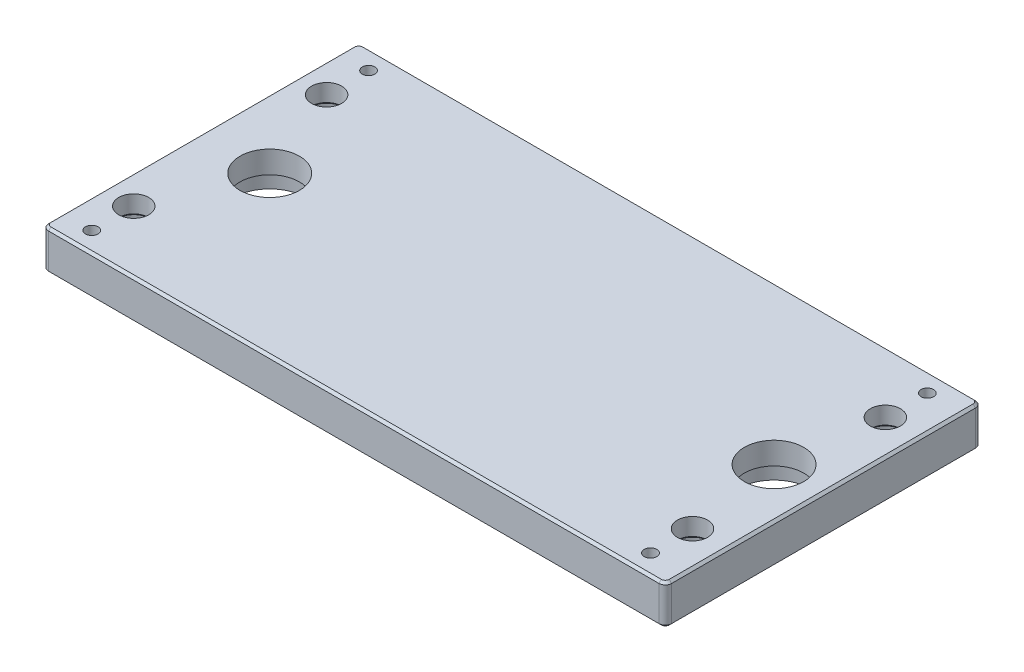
ISO-10303-21;
HEADER;
FILE_DESCRIPTION(('STEP AP214'),'2;1');
FILE_NAME('part.step','',(''),(''),'','','');
FILE_SCHEMA(('AUTOMOTIVE_DESIGN { 1 0 10303 214 1 1 1 1 }'));
ENDSEC;
DATA;
#1=APPLICATION_CONTEXT('core data for automotive mechanical design processes');
#2=APPLICATION_PROTOCOL_DEFINITION('international standard','automotive_design',2000,#1);
#3=PRODUCT_CONTEXT('',#1,'mechanical');
#4=PRODUCT('Part','Part','',(#3));
#5=PRODUCT_RELATED_PRODUCT_CATEGORY('part','',(#4));
#6=PRODUCT_DEFINITION_FORMATION('','',#4);
#7=PRODUCT_DEFINITION_CONTEXT('part definition',#1,'design');
#8=PRODUCT_DEFINITION('design','',#6,#7);
#9=PRODUCT_DEFINITION_SHAPE('','',#8);
#10=(LENGTH_UNIT() NAMED_UNIT(*) SI_UNIT(.MILLI.,.METRE.));
#11=(NAMED_UNIT(*) PLANE_ANGLE_UNIT() SI_UNIT($,.RADIAN.));
#12=(NAMED_UNIT(*) SI_UNIT($,.STERADIAN.) SOLID_ANGLE_UNIT());
#13=UNCERTAINTY_MEASURE_WITH_UNIT(LENGTH_MEASURE(1.E-05),#10,'distance_accuracy_value','');
#14=(GEOMETRIC_REPRESENTATION_CONTEXT(3) GLOBAL_UNCERTAINTY_ASSIGNED_CONTEXT((#13)) GLOBAL_UNIT_ASSIGNED_CONTEXT((#10,
#11,#12)) REPRESENTATION_CONTEXT('',''));
#15=CARTESIAN_POINT('',(0.,0.,0.));
#16=DIRECTION('',(0.,0.,1.));
#17=DIRECTION('',(1.,0.,0.));
#18=AXIS2_PLACEMENT_3D('',#15,#16,#17);
#19=CARTESIAN_POINT('',(-98.425,12.7,-50.8));
#20=DIRECTION('',(0.,0.,1.));
#21=DIRECTION('',(1.,0.,0.));
#22=AXIS2_PLACEMENT_3D('',#19,#20,#21);
#23=PLANE('',#22);
#24=DIRECTION('',(0.,-1.,0.));
#25=VECTOR('',#24,1.);
#26=CARTESIAN_POINT('',(99.568,12.7,-50.8));
#27=LINE('',#26,#25);
#28=CARTESIAN_POINT('',(99.568,11.938,-50.8));
#29=VERTEX_POINT('',#28);
#30=CARTESIAN_POINT('',(99.568,0.761999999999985,-50.8));
#31=VERTEX_POINT('',#30);
#32=EDGE_CURVE('E399',#29,#31,#27,.T.);
#33=ORIENTED_EDGE('',*,*,#32,.T.);
#34=DIRECTION('',(-1.,0.,0.));
#35=VECTOR('',#34,1.);
#36=CARTESIAN_POINT('',(-98.425,0.761999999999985,-50.8));
#37=LINE('',#36,#35);
#38=CARTESIAN_POINT('',(-96.393,0.761999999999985,-50.8));
#39=VERTEX_POINT('',#38);
#40=EDGE_CURVE('E436',#31,#39,#37,.T.);
#41=ORIENTED_EDGE('',*,*,#40,.T.);
#42=DIRECTION('',(0.,-1.,0.));
#43=VECTOR('',#42,1.);
#44=CARTESIAN_POINT('',(-96.393,12.7,-50.8));
#45=LINE('',#44,#43);
#46=CARTESIAN_POINT('',(-96.393,11.938,-50.8));
#47=VERTEX_POINT('',#46);
#48=EDGE_CURVE('E402',#39,#47,#45,.F.);
#49=ORIENTED_EDGE('',*,*,#48,.T.);
#50=DIRECTION('',(1.,0.,0.));
#51=VECTOR('',#50,1.);
#52=CARTESIAN_POINT('',(99.5679999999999,11.938,-50.8));
#53=LINE('',#52,#51);
#54=EDGE_CURVE('E434',#47,#29,#53,.T.);
#55=ORIENTED_EDGE('',*,*,#54,.T.);
#56=EDGE_LOOP('',(#33,#41,#49,#55));
#57=FACE_BOUND('',#56,.T.);
#58=CARTESIAN_POINT('',(-92.9157678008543,5.786216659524,-50.8));
#59=CARTESIAN_POINT('',(-92.87820648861,5.78685123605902,-50.8));
#60=CARTESIAN_POINT('',(-92.8041429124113,5.78810249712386,-50.8));
#61=CARTESIAN_POINT('',(-92.6943980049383,5.80104796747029,-50.8));
#62=CARTESIAN_POINT('',(-92.587877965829,5.82186077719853,-50.8));
#63=CARTESIAN_POINT('',(-92.4840571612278,5.85100265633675,-50.8));
#64=CARTESIAN_POINT('',(-92.3824029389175,5.88667355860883,-50.8));
#65=CARTESIAN_POINT('',(-92.2843004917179,5.93314696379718,-50.8));
#66=CARTESIAN_POINT('',(-92.1886590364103,5.98666939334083,-50.8));
#67=CARTESIAN_POINT('',(-92.0957337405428,6.0476231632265,-50.8));
#68=CARTESIAN_POINT('',(-92.0072707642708,6.11745731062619,-50.8));
#69=CARTESIAN_POINT('',(-91.9227723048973,6.19469728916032,-50.8));
#70=CARTESIAN_POINT('',(-91.8443611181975,6.28127057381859,-50.8));
#71=CARTESIAN_POINT('',(-91.7713804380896,6.37581017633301,-50.8));
#72=CARTESIAN_POINT('',(-91.7020192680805,6.47744633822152,-50.8));
#73=CARTESIAN_POINT('',(-91.6382162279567,6.58756673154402,-50.8));
#74=CARTESIAN_POINT('',(-91.5792008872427,6.70573471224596,-50.8));
#75=CARTESIAN_POINT('',(-91.5252574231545,6.83271372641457,-50.8));
#76=CARTESIAN_POINT('',(-91.4774301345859,6.97035668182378,-50.8));
#77=CARTESIAN_POINT('',(-91.4351830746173,7.12023824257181,-50.8));
#78=CARTESIAN_POINT('',(-91.4018263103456,7.28368130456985,-50.8));
#79=CARTESIAN_POINT('',(-91.3732745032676,7.45937315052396,-50.8));
#80=CARTESIAN_POINT('',(-91.3502452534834,7.64806874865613,-50.8));
#81=CARTESIAN_POINT('',(-91.3345231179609,7.84987053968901,-50.8));
#82=CARTESIAN_POINT('',(-91.324805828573,8.06465277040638,-50.8));
#83=CARTESIAN_POINT('',(-91.3239416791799,8.21197699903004,-50.8));
#84=CARTESIAN_POINT('',(-91.3234976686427,8.28767399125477,-50.8));
#85=B_SPLINE_CURVE_WITH_KNOTS('',3,(#58,#59,#60,#61,#62,#63,#64,#65,#66,#67,#68,#69,#70,#71,#72,
#73,#74,#75,#76,#77,#78,#79,#80,#81,#82,#83,#84),.UNSPECIFIED.,.F.,.F.,(4,1,1,1,1,1,1,1,1,1,1,1,
1,1,1,1,1,1,1,1,1,1,1,1,4),(0.,0.0337871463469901,0.066621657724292,0.0992848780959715,
0.131361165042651,0.163585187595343,0.196103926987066,0.228902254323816,0.262158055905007,
0.295991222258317,0.330217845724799,0.365059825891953,0.400950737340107,0.437620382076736,
0.475707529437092,0.515380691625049,0.556413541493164,0.599764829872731,0.646424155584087,
0.696431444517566,0.749781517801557,0.806573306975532,0.867435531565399,0.931886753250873,1.),.UNSPECIFIED.);
#86=CARTESIAN_POINT('',(-92.9157678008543,5.786216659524,-50.8));
#87=VERTEX_POINT('',#86);
#88=CARTESIAN_POINT('',(-91.3234976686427,8.28767399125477,-50.8));
#89=VERTEX_POINT('',#88);
#90=EDGE_CURVE('E49',#87,#89,#85,.T.);
#91=ORIENTED_EDGE('',*,*,#90,.T.);
#92=CARTESIAN_POINT('',(-91.3234976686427,8.28767399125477,-50.8));
#93=CARTESIAN_POINT('',(-91.3239440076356,8.36400650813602,-50.8));
#94=CARTESIAN_POINT('',(-91.3248110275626,8.5122835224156,-50.8));
#95=CARTESIAN_POINT('',(-91.3344563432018,8.72834405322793,-50.8));
#96=CARTESIAN_POINT('',(-91.3504792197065,8.93103644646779,-50.8));
#97=CARTESIAN_POINT('',(-91.3724375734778,9.12037040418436,-50.8));
#98=CARTESIAN_POINT('',(-91.3991592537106,9.29639480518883,-50.8));
#99=CARTESIAN_POINT('',(-91.434831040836,9.45863924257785,-50.8));
#100=CARTESIAN_POINT('',(-91.4753977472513,9.60785463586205,-50.8));
#101=CARTESIAN_POINT('',(-91.5224137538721,9.74452756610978,-50.8));
#102=CARTESIAN_POINT('',(-91.5754649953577,9.87049936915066,-50.8));
#103=CARTESIAN_POINT('',(-91.633205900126,9.98809937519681,-50.8));
#104=CARTESIAN_POINT('',(-91.6979279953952,10.0971496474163,-50.8));
#105=CARTESIAN_POINT('',(-91.765932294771,10.1993907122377,-50.8));
#106=CARTESIAN_POINT('',(-91.8399715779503,10.2931489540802,-50.8));
#107=CARTESIAN_POINT('',(-91.9179388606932,10.37974843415,-50.8));
#108=CARTESIAN_POINT('',(-92.002877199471,10.4571877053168,-50.8));
#109=CARTESIAN_POINT('',(-92.0918992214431,10.5277357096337,-50.8));
#110=CARTESIAN_POINT('',(-92.1858109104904,10.5895794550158,-50.8));
#111=CARTESIAN_POINT('',(-92.2819353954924,10.6440525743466,-50.8));
#112=CARTESIAN_POINT('',(-92.3809343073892,10.6905888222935,-50.8));
#113=CARTESIAN_POINT('',(-92.4830779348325,10.7271790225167,-50.8));
#114=CARTESIAN_POINT('',(-92.5874482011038,10.757401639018,-50.8));
#115=CARTESIAN_POINT('',(-92.6944099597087,10.7780694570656,-50.8));
#116=CARTESIAN_POINT('',(-92.8041398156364,10.7910736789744,-50.8));
#117=CARTESIAN_POINT('',(-92.8782054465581,10.7923169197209,-50.8));
#118=CARTESIAN_POINT('',(-92.9157678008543,10.7929474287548,-50.8));
#119=B_SPLINE_CURVE_WITH_KNOTS('',3,(#92,#93,#94,#95,#96,#97,#98,#99,#100,#101,#102,#103,#104,
#105,#106,#107,#108,#109,#110,#111,#112,#113,#114,#115,#116,#117,#118),.UNSPECIFIED.,.F.,.F.,(4,
1,1,1,1,1,1,1,1,1,1,1,1,1,1,1,1,1,1,1,1,1,1,1,4),(0.,0.0685946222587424,0.133246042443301,
0.194312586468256,0.251279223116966,0.304513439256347,0.354234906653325,0.400480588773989,
0.443410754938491,0.484014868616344,0.523252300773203,0.56104237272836,0.597900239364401,
0.633518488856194,0.66831435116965,0.702495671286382,0.736685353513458,0.770293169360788,
0.803437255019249,0.835912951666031,0.868460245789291,0.900846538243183,0.93346652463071,
0.966257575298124,1.),.UNSPECIFIED.);
#120=CARTESIAN_POINT('',(-92.9157678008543,10.7929474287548,-50.8));
#121=VERTEX_POINT('',#120);
#122=EDGE_CURVE('E278',#89,#121,#119,.T.);
#123=ORIENTED_EDGE('',*,*,#122,.T.);
#124=CARTESIAN_POINT('',(-92.9157678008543,10.7929474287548,-50.8));
#125=CARTESIAN_POINT('',(-92.9536439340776,10.7922836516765,-50.8));
#126=CARTESIAN_POINT('',(-93.0289676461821,10.7909636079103,-50.8));
#127=CARTESIAN_POINT('',(-93.1403290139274,10.7782763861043,-50.8));
#128=CARTESIAN_POINT('',(-93.2491176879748,10.7572246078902,-50.8));
#129=CARTESIAN_POINT('',(-93.3548698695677,10.7273964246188,-50.8));
#130=CARTESIAN_POINT('',(-93.4584542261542,10.6903908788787,-50.8));
#131=CARTESIAN_POINT('',(-93.5590605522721,10.6440080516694,-50.8));
#132=CARTESIAN_POINT('',(-93.6573137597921,10.5900164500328,-50.8));
#133=CARTESIAN_POINT('',(-93.7516524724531,10.5265746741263,-50.8));
#134=CARTESIAN_POINT('',(-93.8431123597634,10.4558416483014,-50.8));
#135=CARTESIAN_POINT('',(-93.9294469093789,10.375882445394,-50.8));
#136=CARTESIAN_POINT('',(-94.0106639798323,10.287504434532,-50.8));
#137=CARTESIAN_POINT('',(-94.0877828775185,10.1916531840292,-50.8));
#138=CARTESIAN_POINT('',(-94.158615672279,10.0864902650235,-50.8));
#139=CARTESIAN_POINT('',(-94.2260709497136,9.97384474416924,-50.8));
#140=CARTESIAN_POINT('',(-94.2864486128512,9.8517466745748,-50.8));
#141=CARTESIAN_POINT('',(-94.3445982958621,9.72223325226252,-50.8));
#142=CARTESIAN_POINT('',(-94.3947909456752,9.58172091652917,-50.8));
#143=CARTESIAN_POINT('',(-94.4400568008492,9.43100172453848,-50.8));
#144=CARTESIAN_POINT('',(-94.4766313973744,9.26829542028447,-50.8));
#145=CARTESIAN_POINT('',(-94.5070968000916,9.09445567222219,-50.8));
#146=CARTESIAN_POINT('',(-94.5306982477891,8.90884406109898,-50.8));
#147=CARTESIAN_POINT('',(-94.5478876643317,8.7118584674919,-50.8));
#148=CARTESIAN_POINT('',(-94.5569678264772,8.50336929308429,-50.8));
#149=CARTESIAN_POINT('',(-94.558677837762,8.36082379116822,-50.8));
#150=CARTESIAN_POINT('',(-94.5595553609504,8.28767399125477,-50.8));
#151=B_SPLINE_CURVE_WITH_KNOTS('',3,(#124,#125,#126,#127,#128,#129,#130,#131,#132,#133,#134,
#135,#136,#137,#138,#139,#140,#141,#142,#143,#144,#145,#146,#147,#148,#149,#150),.UNSPECIFIED.,
.F.,.F.,(4,1,1,1,1,1,1,1,1,1,1,1,1,1,1,1,1,1,1,1,1,1,1,1,4),(0.,0.0337881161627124,
0.0671939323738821,0.0998624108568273,0.132566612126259,0.165151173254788,0.197913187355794,
0.231319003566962,0.265083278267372,0.299255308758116,0.334398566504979,0.369942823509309,
0.40628356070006,0.444063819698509,0.482997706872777,0.523354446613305,0.565536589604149,
0.60961292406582,0.656390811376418,0.705885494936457,0.758324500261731,0.81383178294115,
0.87279455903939,0.934722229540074,1.),.UNSPECIFIED.);
#152=CARTESIAN_POINT('',(-94.5595553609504,8.28767399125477,-50.8));
#153=VERTEX_POINT('',#152);
#154=EDGE_CURVE('E286',#121,#153,#151,.T.);
#155=ORIENTED_EDGE('',*,*,#154,.T.);
#156=CARTESIAN_POINT('',(-94.5595553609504,8.28767399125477,-50.8));
#157=CARTESIAN_POINT('',(-94.5586687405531,8.21484324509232,-50.8));
#158=CARTESIAN_POINT('',(-94.5569411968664,8.07293550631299,-50.8));
#159=CARTESIAN_POINT('',(-94.5479894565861,7.86538442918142,-50.8));
#160=CARTESIAN_POINT('',(-94.5303564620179,7.66944423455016,-50.8));
#161=CARTESIAN_POINT('',(-94.5082992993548,7.48464499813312,-50.8));
#162=CARTESIAN_POINT('',(-94.4777499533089,7.31175588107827,-50.8));
#163=CARTESIAN_POINT('',(-94.4401872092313,7.15017861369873,-50.8));
#164=CARTESIAN_POINT('',(-94.3984808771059,6.99921543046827,-50.8));
#165=CARTESIAN_POINT('',(-94.3469985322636,6.8601030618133,-50.8));
#166=CARTESIAN_POINT('',(-94.2906503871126,6.73090089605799,-50.8));
#167=CARTESIAN_POINT('',(-94.2293431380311,6.61025024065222,-50.8));
#168=CARTESIAN_POINT('',(-94.1636616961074,6.49708467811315,-50.8));
#169=CARTESIAN_POINT('',(-94.0921034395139,6.39231002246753,-50.8));
#170=CARTESIAN_POINT('',(-94.0158307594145,6.29518406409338,-50.8));
#171=CARTESIAN_POINT('',(-93.9332111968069,6.20742122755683,-50.8));
#172=CARTESIAN_POINT('',(-93.8465737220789,6.12690684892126,-50.8));
#173=CARTESIAN_POINT('',(-93.7548446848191,6.05526302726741,-50.8));
#174=CARTESIAN_POINT('',(-93.6590346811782,5.99255477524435,-50.8));
#175=CARTESIAN_POINT('',(-93.5611189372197,5.93647450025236,-50.8));
#176=CARTESIAN_POINT('',(-93.459360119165,5.89125429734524,-50.8));
#177=CARTESIAN_POINT('',(-93.3560642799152,5.85242625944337,-50.8));
#178=CARTESIAN_POINT('',(-93.2497538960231,5.82276207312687,-50.8));
#179=CARTESIAN_POINT('',(-93.140561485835,5.80225086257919,-50.8));
#180=CARTESIAN_POINT('',(-93.0290424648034,5.78786559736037,-50.8));
#181=CARTESIAN_POINT('',(-92.9536567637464,5.7867682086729,-50.8));
#182=CARTESIAN_POINT('',(-92.9157678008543,5.786216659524,-50.8));
#183=B_SPLINE_CURVE_WITH_KNOTS('',3,(#156,#157,#158,#159,#160,#161,#162,#163,#164,#165,#166,
#167,#168,#169,#170,#171,#172,#173,#174,#175,#176,#177,#178,#179,#180,#181,#182),.UNSPECIFIED.,
.F.,.F.,(4,1,1,1,1,1,1,1,1,1,1,1,1,1,1,1,1,1,1,1,1,1,1,1,4),(0.,0.0650632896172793,
0.126773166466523,0.185515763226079,0.240764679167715,0.292979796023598,0.342250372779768,
0.38891928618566,0.432775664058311,0.474628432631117,0.514774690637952,0.553605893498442,
0.591426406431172,0.628028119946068,0.663803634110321,0.698984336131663,0.733591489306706,
0.767628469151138,0.801208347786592,0.834263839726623,0.866980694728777,0.899719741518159,
0.932701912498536,0.966175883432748,1.),.UNSPECIFIED.);
#184=EDGE_CURVE('E294',#153,#87,#183,.T.);
#185=ORIENTED_EDGE('',*,*,#184,.T.);
#186=EDGE_LOOP('',(#91,#123,#155,#185));
#187=FACE_BOUND('',#186,.T.);
#188=ADVANCED_FACE('F34',(#57,#187),#23,.F.);
#189=CARTESIAN_POINT('',(0.,12.7,0.));
#190=DIRECTION('',(0.,1.,0.));
#191=DIRECTION('',(0.,0.,1.));
#192=AXIS2_PLACEMENT_3D('',#189,#190,#191);
#193=PLANE('',#192);
#194=CARTESIAN_POINT('',(99.568,12.7,-48.768));
#195=DIRECTION('',(0.,1.,0.));
#196=DIRECTION('',(0.,0.,1.));
#197=AXIS2_PLACEMENT_3D('',#194,#195,#196);
#198=CIRCLE('',#197,1.27000000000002);
#199=CARTESIAN_POINT('',(100.838,12.7,-48.768));
#200=VERTEX_POINT('',#199);
#201=CARTESIAN_POINT('',(99.568,12.7,-50.038));
#202=VERTEX_POINT('',#201);
#203=EDGE_CURVE('E473',#200,#202,#198,.T.);
#204=ORIENTED_EDGE('',*,*,#203,.T.);
#205=DIRECTION('',(-1.,0.,0.));
#206=VECTOR('',#205,1.);
#207=CARTESIAN_POINT('',(-96.393,12.7,-50.038));
#208=LINE('',#207,#206);
#209=CARTESIAN_POINT('',(-96.393,12.7,-50.038));
#210=VERTEX_POINT('',#209);
#211=EDGE_CURVE('E477',#202,#210,#208,.T.);
#212=ORIENTED_EDGE('',*,*,#211,.T.);
#213=CARTESIAN_POINT('',(-96.393,12.7,-48.768));
#214=DIRECTION('',(0.,1.,0.));
#215=DIRECTION('',(0.,0.,1.));
#216=AXIS2_PLACEMENT_3D('',#213,#214,#215);
#217=CIRCLE('',#216,1.27000000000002);
#218=CARTESIAN_POINT('',(-97.6630000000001,12.7,-48.768));
#219=VERTEX_POINT('',#218);
#220=EDGE_CURVE('E475',#210,#219,#217,.T.);
#221=ORIENTED_EDGE('',*,*,#220,.T.);
#222=DIRECTION('',(0.,0.,1.));
#223=VECTOR('',#222,1.);
#224=CARTESIAN_POINT('',(-97.663,12.7,48.768));
#225=LINE('',#224,#223);
#226=CARTESIAN_POINT('',(-97.663,12.7,48.768));
#227=VERTEX_POINT('',#226);
#228=EDGE_CURVE('E470',#219,#227,#225,.T.);
#229=ORIENTED_EDGE('',*,*,#228,.T.);
#230=CARTESIAN_POINT('',(-96.3929999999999,12.7,48.768));
#231=DIRECTION('',(0.,1.,0.));
#232=DIRECTION('',(0.,0.,1.));
#233=AXIS2_PLACEMENT_3D('',#230,#231,#232);
#234=CIRCLE('',#233,1.27000000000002);
#235=CARTESIAN_POINT('',(-96.3929999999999,12.7,50.038));
#236=VERTEX_POINT('',#235);
#237=EDGE_CURVE('E466',#227,#236,#234,.T.);
#238=ORIENTED_EDGE('',*,*,#237,.T.);
#239=DIRECTION('',(1.,0.,0.));
#240=VECTOR('',#239,1.);
#241=CARTESIAN_POINT('',(99.568,12.7,50.038));
#242=LINE('',#241,#240);
#243=CARTESIAN_POINT('',(99.568,12.7,50.038));
#244=VERTEX_POINT('',#243);
#245=EDGE_CURVE('E462',#236,#244,#242,.T.);
#246=ORIENTED_EDGE('',*,*,#245,.T.);
#247=CARTESIAN_POINT('',(99.568,12.7,48.768));
#248=DIRECTION('',(0.,1.,0.));
#249=DIRECTION('',(0.,0.,1.));
#250=AXIS2_PLACEMENT_3D('',#247,#248,#249);
#251=CIRCLE('',#250,1.27000000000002);
#252=CARTESIAN_POINT('',(100.838,12.7,48.768));
#253=VERTEX_POINT('',#252);
#254=EDGE_CURVE('E464',#244,#253,#251,.T.);
#255=ORIENTED_EDGE('',*,*,#254,.T.);
#256=DIRECTION('',(0.,0.,-1.));
#257=VECTOR('',#256,1.);
#258=CARTESIAN_POINT('',(100.838,12.7,-48.768));
#259=LINE('',#258,#257);
#260=EDGE_CURVE('E468',#253,#200,#259,.T.);
#261=ORIENTED_EDGE('',*,*,#260,.T.);
#262=EDGE_LOOP('',(#204,#212,#221,#229,#238,#246,#255,#261));
#263=FACE_BOUND('',#262,.T.);
#264=CARTESIAN_POINT('',(-88.9,12.7,30.9626));
#265=DIRECTION('',(0.,1.,0.));
#266=DIRECTION('',(0.,0.,1.));
#267=AXIS2_PLACEMENT_3D('',#264,#265,#266);
#268=CIRCLE('',#267,4.826);
#269=CARTESIAN_POINT('',(-88.9,12.7,35.7886));
#270=VERTEX_POINT('',#269);
#271=EDGE_CURVE('E321',#270,#270,#268,.T.);
#272=ORIENTED_EDGE('',*,*,#271,.F.);
#273=EDGE_LOOP('',(#272));
#274=FACE_BOUND('',#273,.T.);
#275=CARTESIAN_POINT('',(90.5002,12.7,30.9626));
#276=DIRECTION('',(0.,1.,0.));
#277=DIRECTION('',(0.,0.,1.));
#278=AXIS2_PLACEMENT_3D('',#275,#276,#277);
#279=CIRCLE('',#278,4.826);
#280=CARTESIAN_POINT('',(90.5002,12.7,35.7886));
#281=VERTEX_POINT('',#280);
#282=EDGE_CURVE('E328',#281,#281,#279,.T.);
#283=ORIENTED_EDGE('',*,*,#282,.F.);
#284=EDGE_LOOP('',(#283));
#285=FACE_BOUND('',#284,.T.);
#286=CARTESIAN_POINT('',(90.5002,12.7,-30.9626));
#287=DIRECTION('',(0.,1.,0.));
#288=DIRECTION('',(0.,0.,1.));
#289=AXIS2_PLACEMENT_3D('',#286,#287,#288);
#290=CIRCLE('',#289,4.826);
#291=CARTESIAN_POINT('',(90.5002,12.7,-26.1366));
#292=VERTEX_POINT('',#291);
#293=EDGE_CURVE('E335',#292,#292,#290,.T.);
#294=ORIENTED_EDGE('',*,*,#293,.F.);
#295=EDGE_LOOP('',(#294));
#296=FACE_BOUND('',#295,.T.);
#297=CARTESIAN_POINT('',(-88.9,12.7,-30.9626));
#298=DIRECTION('',(0.,1.,0.));
#299=DIRECTION('',(0.,0.,1.));
#300=AXIS2_PLACEMENT_3D('',#297,#298,#299);
#301=CIRCLE('',#300,4.826);
#302=CARTESIAN_POINT('',(-88.9,12.7,-26.1366));
#303=VERTEX_POINT('',#302);
#304=EDGE_CURVE('E342',#303,#303,#301,.T.);
#305=ORIENTED_EDGE('',*,*,#304,.F.);
#306=EDGE_LOOP('',(#305));
#307=FACE_BOUND('',#306,.T.);
#308=CARTESIAN_POINT('',(-76.2,12.7,0.));
#309=DIRECTION('',(0.,1.,0.));
#310=DIRECTION('',(0.,0.,1.));
#311=AXIS2_PLACEMENT_3D('',#308,#309,#310);
#312=CIRCLE('',#311,9.5377);
#313=CARTESIAN_POINT('',(-76.2,12.7,9.5377));
#314=VERTEX_POINT('',#313);
#315=EDGE_CURVE('E352',#314,#314,#312,.T.);
#316=ORIENTED_EDGE('',*,*,#315,.F.);
#317=EDGE_LOOP('',(#316));
#318=FACE_BOUND('',#317,.T.);
#319=CARTESIAN_POINT('',(85.725,12.7,0.));
#320=DIRECTION('',(0.,1.,0.));
#321=DIRECTION('',(0.,0.,1.));
#322=AXIS2_PLACEMENT_3D('',#319,#320,#321);
#323=CIRCLE('',#322,9.5377);
#324=CARTESIAN_POINT('',(85.725,12.7,9.5377));
#325=VERTEX_POINT('',#324);
#326=EDGE_CURVE('E362',#325,#325,#323,.T.);
#327=ORIENTED_EDGE('',*,*,#326,.F.);
#328=EDGE_LOOP('',(#327));
#329=FACE_BOUND('',#328,.T.);
#330=CARTESIAN_POINT('',(-88.9,12.7,44.45));
#331=DIRECTION('',(0.,-1.,0.));
#332=DIRECTION('',(0.,0.,-1.));
#333=AXIS2_PLACEMENT_3D('',#330,#331,#332);
#334=CIRCLE('',#333,2.0193);
#335=CARTESIAN_POINT('',(-88.9,12.7,42.4307));
#336=VERTEX_POINT('',#335);
#337=EDGE_CURVE('E363',#336,#336,#334,.T.);
#338=ORIENTED_EDGE('',*,*,#337,.T.);
#339=EDGE_LOOP('',(#338));
#340=FACE_BOUND('',#339,.T.);
#341=CARTESIAN_POINT('',(-88.9,12.7,-44.45));
#342=DIRECTION('',(0.,-1.,0.));
#343=DIRECTION('',(0.,0.,-1.));
#344=AXIS2_PLACEMENT_3D('',#341,#342,#343);
#345=CIRCLE('',#344,2.0193);
#346=CARTESIAN_POINT('',(-88.9,12.7,-46.4693));
#347=VERTEX_POINT('',#346);
#348=EDGE_CURVE('E372',#347,#347,#345,.T.);
#349=ORIENTED_EDGE('',*,*,#348,.T.);
#350=EDGE_LOOP('',(#349));
#351=FACE_BOUND('',#350,.T.);
#352=CARTESIAN_POINT('',(90.5002,12.7,-44.45));
#353=DIRECTION('',(0.,-1.,0.));
#354=DIRECTION('',(0.,0.,-1.));
#355=AXIS2_PLACEMENT_3D('',#352,#353,#354);
#356=CIRCLE('',#355,2.0193);
#357=CARTESIAN_POINT('',(90.5002,12.7,-46.4693));
#358=VERTEX_POINT('',#357);
#359=EDGE_CURVE('E369',#358,#358,#356,.T.);
#360=ORIENTED_EDGE('',*,*,#359,.T.);
#361=EDGE_LOOP('',(#360));
#362=FACE_BOUND('',#361,.T.);
#363=CARTESIAN_POINT('',(90.5002,12.7,44.45));
#364=DIRECTION('',(0.,-1.,0.));
#365=DIRECTION('',(0.,0.,-1.));
#366=AXIS2_PLACEMENT_3D('',#363,#364,#365);
#367=CIRCLE('',#366,2.0193);
#368=CARTESIAN_POINT('',(90.5002,12.7,42.4307));
#369=VERTEX_POINT('',#368);
#370=EDGE_CURVE('E366',#369,#369,#367,.T.);
#371=ORIENTED_EDGE('',*,*,#370,.T.);
#372=EDGE_LOOP('',(#371));
#373=FACE_BOUND('',#372,.T.);
#374=ADVANCED_FACE('F583',(#263,#274,#285,#296,#307,#318,#329,#340,#351,#362,#373),#193,.T.);
#375=CARTESIAN_POINT('',(0.,0.,0.));
#376=DIRECTION('',(0.,1.,0.));
#377=DIRECTION('',(0.,0.,1.));
#378=AXIS2_PLACEMENT_3D('',#375,#376,#377);
#379=PLANE('',#378);
#380=CARTESIAN_POINT('',(90.5002,0.,-44.45));
#381=DIRECTION('',(0.,1.,0.));
#382=DIRECTION('',(0.,0.,1.));
#383=AXIS2_PLACEMENT_3D('',#380,#381,#382);
#384=CIRCLE('',#383,2.78130000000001);
#385=CARTESIAN_POINT('',(90.5002,0.,-41.6687));
#386=VERTEX_POINT('',#385);
#387=EDGE_CURVE('E557',#386,#386,#384,.T.);
#388=ORIENTED_EDGE('',*,*,#387,.T.);
#389=EDGE_LOOP('',(#388));
#390=FACE_BOUND('',#389,.T.);
#391=CARTESIAN_POINT('',(-88.9,0.,-44.45));
#392=DIRECTION('',(0.,1.,0.));
#393=DIRECTION('',(0.,0.,1.));
#394=AXIS2_PLACEMENT_3D('',#391,#392,#393);
#395=CIRCLE('',#394,2.78130000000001);
#396=CARTESIAN_POINT('',(-88.9,0.,-41.6687));
#397=VERTEX_POINT('',#396);
#398=EDGE_CURVE('E554',#397,#397,#395,.T.);
#399=ORIENTED_EDGE('',*,*,#398,.T.);
#400=EDGE_LOOP('',(#399));
#401=FACE_BOUND('',#400,.T.);
#402=CARTESIAN_POINT('',(-88.9,0.,44.45));
#403=DIRECTION('',(0.,1.,0.));
#404=DIRECTION('',(0.,0.,1.));
#405=AXIS2_PLACEMENT_3D('',#402,#403,#404);
#406=CIRCLE('',#405,2.78130000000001);
#407=CARTESIAN_POINT('',(-88.9,0.,47.2313));
#408=VERTEX_POINT('',#407);
#409=EDGE_CURVE('E551',#408,#408,#406,.T.);
#410=ORIENTED_EDGE('',*,*,#409,.T.);
#411=EDGE_LOOP('',(#410));
#412=FACE_BOUND('',#411,.T.);
#413=CARTESIAN_POINT('',(90.5002,0.,44.45));
#414=DIRECTION('',(0.,1.,0.));
#415=DIRECTION('',(0.,0.,1.));
#416=AXIS2_PLACEMENT_3D('',#413,#414,#415);
#417=CIRCLE('',#416,2.78130000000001);
#418=CARTESIAN_POINT('',(90.5002,0.,47.2313));
#419=VERTEX_POINT('',#418);
#420=EDGE_CURVE('E548',#419,#419,#417,.T.);
#421=ORIENTED_EDGE('',*,*,#420,.T.);
#422=EDGE_LOOP('',(#421));
#423=FACE_BOUND('',#422,.T.);
#424=CARTESIAN_POINT('',(-96.393,0.,-48.768));
#425=DIRECTION('',(0.,1.,0.));
#426=DIRECTION('',(0.,0.,1.));
#427=AXIS2_PLACEMENT_3D('',#424,#425,#426);
#428=CIRCLE('',#427,1.27000000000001);
#429=CARTESIAN_POINT('',(-97.663,0.,-48.768));
#430=VERTEX_POINT('',#429);
#431=CARTESIAN_POINT('',(-96.393,0.,-50.038));
#432=VERTEX_POINT('',#431);
#433=EDGE_CURVE('E430',#430,#432,#428,.F.);
#434=ORIENTED_EDGE('',*,*,#433,.T.);
#435=DIRECTION('',(1.,0.,0.));
#436=VECTOR('',#435,1.);
#437=CARTESIAN_POINT('',(0.,0.,-50.038));
#438=LINE('',#437,#436);
#439=CARTESIAN_POINT('',(99.568,0.,-50.038));
#440=VERTEX_POINT('',#439);
#441=EDGE_CURVE('E432',#432,#440,#438,.T.);
#442=ORIENTED_EDGE('',*,*,#441,.T.);
#443=CARTESIAN_POINT('',(99.568,0.,-48.768));
#444=DIRECTION('',(0.,1.,0.));
#445=DIRECTION('',(0.,0.,1.));
#446=AXIS2_PLACEMENT_3D('',#443,#444,#445);
#447=CIRCLE('',#446,1.27000000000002);
#448=CARTESIAN_POINT('',(100.838,0.,-48.768));
#449=VERTEX_POINT('',#448);
#450=EDGE_CURVE('E428',#440,#449,#447,.F.);
#451=ORIENTED_EDGE('',*,*,#450,.T.);
#452=DIRECTION('',(0.,0.,1.));
#453=VECTOR('',#452,1.);
#454=CARTESIAN_POINT('',(100.838,0.,0.));
#455=LINE('',#454,#453);
#456=CARTESIAN_POINT('',(100.838,0.,48.768));
#457=VERTEX_POINT('',#456);
#458=EDGE_CURVE('E423',#449,#457,#455,.T.);
#459=ORIENTED_EDGE('',*,*,#458,.T.);
#460=CARTESIAN_POINT('',(99.568,0.,48.768));
#461=DIRECTION('',(0.,1.,0.));
#462=DIRECTION('',(0.,0.,1.));
#463=AXIS2_PLACEMENT_3D('',#460,#461,#462);
#464=CIRCLE('',#463,1.27000000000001);
#465=CARTESIAN_POINT('',(99.568,0.,50.038));
#466=VERTEX_POINT('',#465);
#467=EDGE_CURVE('E419',#457,#466,#464,.F.);
#468=ORIENTED_EDGE('',*,*,#467,.T.);
#469=DIRECTION('',(-1.,0.,0.));
#470=VECTOR('',#469,1.);
#471=CARTESIAN_POINT('',(0.,0.,50.038));
#472=LINE('',#471,#470);
#473=CARTESIAN_POINT('',(-96.3929999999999,0.,50.038));
#474=VERTEX_POINT('',#473);
#475=EDGE_CURVE('E417',#466,#474,#472,.T.);
#476=ORIENTED_EDGE('',*,*,#475,.T.);
#477=CARTESIAN_POINT('',(-96.3929999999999,0.,48.768));
#478=DIRECTION('',(0.,1.,0.));
#479=DIRECTION('',(0.,0.,1.));
#480=AXIS2_PLACEMENT_3D('',#477,#478,#479);
#481=CIRCLE('',#480,1.27000000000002);
#482=CARTESIAN_POINT('',(-97.663,0.,48.768));
#483=VERTEX_POINT('',#482);
#484=EDGE_CURVE('E421',#474,#483,#481,.F.);
#485=ORIENTED_EDGE('',*,*,#484,.T.);
#486=DIRECTION('',(0.,0.,-1.));
#487=VECTOR('',#486,1.);
#488=CARTESIAN_POINT('',(-97.663,0.,0.));
#489=LINE('',#488,#487);
#490=EDGE_CURVE('E425',#483,#430,#489,.T.);
#491=ORIENTED_EDGE('',*,*,#490,.T.);
#492=EDGE_LOOP('',(#434,#442,#451,#459,#468,#476,#485,#491));
#493=FACE_BOUND('',#492,.T.);
#494=CARTESIAN_POINT('',(-88.9,0.,30.9626));
#495=DIRECTION('',(0.,-1.,0.));
#496=DIRECTION('',(0.,0.,-1.));
#497=AXIS2_PLACEMENT_3D('',#494,#495,#496);
#498=CIRCLE('',#497,8.128);
#499=CARTESIAN_POINT('',(-88.9,0.,22.8346));
#500=VERTEX_POINT('',#499);
#501=EDGE_CURVE('E314',#500,#500,#498,.T.);
#502=ORIENTED_EDGE('',*,*,#501,.F.);
#503=EDGE_LOOP('',(#502));
#504=FACE_BOUND('',#503,.T.);
#505=CARTESIAN_POINT('',(90.5002,0.,30.9626));
#506=DIRECTION('',(0.,-1.,0.));
#507=DIRECTION('',(0.,0.,-1.));
#508=AXIS2_PLACEMENT_3D('',#505,#506,#507);
#509=CIRCLE('',#508,8.128);
#510=CARTESIAN_POINT('',(90.5002,0.,22.8346));
#511=VERTEX_POINT('',#510);
#512=EDGE_CURVE('E322',#511,#511,#509,.T.);
#513=ORIENTED_EDGE('',*,*,#512,.F.);
#514=EDGE_LOOP('',(#513));
#515=FACE_BOUND('',#514,.T.);
#516=CARTESIAN_POINT('',(90.5002,0.,-30.9626));
#517=DIRECTION('',(0.,-1.,0.));
#518=DIRECTION('',(0.,0.,-1.));
#519=AXIS2_PLACEMENT_3D('',#516,#517,#518);
#520=CIRCLE('',#519,8.128);
#521=CARTESIAN_POINT('',(90.5002,0.,-39.0906));
#522=VERTEX_POINT('',#521);
#523=EDGE_CURVE('E329',#522,#522,#520,.T.);
#524=ORIENTED_EDGE('',*,*,#523,.F.);
#525=EDGE_LOOP('',(#524));
#526=FACE_BOUND('',#525,.T.);
#527=CARTESIAN_POINT('',(-88.9,0.,-30.9626));
#528=DIRECTION('',(0.,-1.,0.));
#529=DIRECTION('',(0.,0.,-1.));
#530=AXIS2_PLACEMENT_3D('',#527,#528,#529);
#531=CIRCLE('',#530,8.128);
#532=CARTESIAN_POINT('',(-88.9,0.,-39.0906));
#533=VERTEX_POINT('',#532);
#534=EDGE_CURVE('E336',#533,#533,#531,.T.);
#535=ORIENTED_EDGE('',*,*,#534,.F.);
#536=EDGE_LOOP('',(#535));
#537=FACE_BOUND('',#536,.T.);
#538=CARTESIAN_POINT('',(-76.2,0.,0.));
#539=DIRECTION('',(0.,-1.,0.));
#540=DIRECTION('',(0.,0.,-1.));
#541=AXIS2_PLACEMENT_3D('',#538,#539,#540);
#542=CIRCLE('',#541,11.811);
#543=CARTESIAN_POINT('',(-76.2,0.,-11.811));
#544=VERTEX_POINT('',#543);
#545=EDGE_CURVE('E343',#544,#544,#542,.T.);
#546=ORIENTED_EDGE('',*,*,#545,.F.);
#547=EDGE_LOOP('',(#546));
#548=FACE_BOUND('',#547,.T.);
#549=CARTESIAN_POINT('',(85.725,0.,0.));
#550=DIRECTION('',(0.,-1.,0.));
#551=DIRECTION('',(0.,0.,-1.));
#552=AXIS2_PLACEMENT_3D('',#549,#550,#551);
#553=CIRCLE('',#552,11.811);
#554=CARTESIAN_POINT('',(85.725,0.,-11.811));
#555=VERTEX_POINT('',#554);
#556=EDGE_CURVE('E353',#555,#555,#553,.T.);
#557=ORIENTED_EDGE('',*,*,#556,.F.);
#558=EDGE_LOOP('',(#557));
#559=FACE_BOUND('',#558,.T.);
#560=ADVANCED_FACE('F590',(#390,#401,#412,#423,#493,#504,#515,#526,#537,#548,#559),#379,.F.);
#561=CARTESIAN_POINT('',(-98.425,12.7,-50.8));
#562=DIRECTION('',(1.,0.,0.));
#563=DIRECTION('',(0.,0.,-1.));
#564=AXIS2_PLACEMENT_3D('',#561,#562,#563);
#565=PLANE('',#564);
#566=DIRECTION('',(0.,-1.,0.));
#567=VECTOR('',#566,1.);
#568=CARTESIAN_POINT('',(-98.425,12.7,-48.768));
#569=LINE('',#568,#567);
#570=CARTESIAN_POINT('',(-98.425,11.938,-48.768));
#571=VERTEX_POINT('',#570);
#572=CARTESIAN_POINT('',(-98.425,0.761999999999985,-48.768));
#573=VERTEX_POINT('',#572);
#574=EDGE_CURVE('E393',#571,#573,#569,.T.);
#575=ORIENTED_EDGE('',*,*,#574,.T.);
#576=DIRECTION('',(0.,0.,1.));
#577=VECTOR('',#576,1.);
#578=CARTESIAN_POINT('',(-98.425,0.761999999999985,-50.8));
#579=LINE('',#578,#577);
#580=CARTESIAN_POINT('',(-98.425,0.761999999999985,48.768));
#581=VERTEX_POINT('',#580);
#582=EDGE_CURVE('E414',#573,#581,#579,.T.);
#583=ORIENTED_EDGE('',*,*,#582,.T.);
#584=DIRECTION('',(0.,-1.,0.));
#585=VECTOR('',#584,1.);
#586=CARTESIAN_POINT('',(-98.425,12.7,48.768));
#587=LINE('',#586,#585);
#588=CARTESIAN_POINT('',(-98.425,11.938,48.768));
#589=VERTEX_POINT('',#588);
#590=EDGE_CURVE('E396',#581,#589,#587,.F.);
#591=ORIENTED_EDGE('',*,*,#590,.T.);
#592=DIRECTION('',(0.,0.,-1.));
#593=VECTOR('',#592,1.);
#594=CARTESIAN_POINT('',(-98.425,11.938,-48.768));
#595=LINE('',#594,#593);
#596=EDGE_CURVE('E411',#589,#571,#595,.T.);
#597=ORIENTED_EDGE('',*,*,#596,.T.);
#598=EDGE_LOOP('',(#575,#583,#591,#597));
#599=FACE_BOUND('',#598,.T.);
#600=ADVANCED_FACE('F749',(#599),#565,.F.);
#601=CARTESIAN_POINT('',(-98.425,12.7,50.8));
#602=DIRECTION('',(0.,0.,-1.));
#603=DIRECTION('',(-1.,0.,0.));
#604=AXIS2_PLACEMENT_3D('',#601,#602,#603);
#605=PLANE('',#604);
#606=DIRECTION('',(0.,-1.,0.));
#607=VECTOR('',#606,1.);
#608=CARTESIAN_POINT('',(-96.3929999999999,12.7,50.8));
#609=LINE('',#608,#607);
#610=CARTESIAN_POINT('',(-96.3929999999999,11.938,50.8));
#611=VERTEX_POINT('',#610);
#612=CARTESIAN_POINT('',(-96.3929999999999,0.761999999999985,50.8));
#613=VERTEX_POINT('',#612);
#614=EDGE_CURVE('E390',#611,#613,#609,.T.);
#615=ORIENTED_EDGE('',*,*,#614,.T.);
#616=DIRECTION('',(1.,0.,0.));
#617=VECTOR('',#616,1.);
#618=CARTESIAN_POINT('',(-98.425,0.761999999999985,50.8));
#619=LINE('',#618,#617);
#620=CARTESIAN_POINT('',(99.568,0.761999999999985,50.8));
#621=VERTEX_POINT('',#620);
#622=EDGE_CURVE('E460',#613,#621,#619,.T.);
#623=ORIENTED_EDGE('',*,*,#622,.T.);
#624=DIRECTION('',(0.,-1.,0.));
#625=VECTOR('',#624,1.);
#626=CARTESIAN_POINT('',(99.568,12.7,50.8));
#627=LINE('',#626,#625);
#628=CARTESIAN_POINT('',(99.568,11.938,50.8));
#629=VERTEX_POINT('',#628);
#630=EDGE_CURVE('E375',#621,#629,#627,.F.);
#631=ORIENTED_EDGE('',*,*,#630,.T.);
#632=DIRECTION('',(-1.,0.,0.));
#633=VECTOR('',#632,1.);
#634=CARTESIAN_POINT('',(-96.3929999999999,11.938,50.8));
#635=LINE('',#634,#633);
#636=EDGE_CURVE('E458',#629,#611,#635,.T.);
#637=ORIENTED_EDGE('',*,*,#636,.T.);
#638=EDGE_LOOP('',(#615,#623,#631,#637));
#639=FACE_BOUND('',#638,.T.);
#640=ADVANCED_FACE('F754',(#639),#605,.F.);
#641=CARTESIAN_POINT('',(101.6,12.7,-50.8));
#642=DIRECTION('',(-1.,0.,0.));
#643=DIRECTION('',(0.,0.,1.));
#644=AXIS2_PLACEMENT_3D('',#641,#642,#643);
#645=PLANE('',#644);
#646=DIRECTION('',(0.,-1.,0.));
#647=VECTOR('',#646,1.);
#648=CARTESIAN_POINT('',(101.6,12.7,48.768));
#649=LINE('',#648,#647);
#650=CARTESIAN_POINT('',(101.6,11.938,48.768));
#651=VERTEX_POINT('',#650);
#652=CARTESIAN_POINT('',(101.6,0.761999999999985,48.768));
#653=VERTEX_POINT('',#652);
#654=EDGE_CURVE('E405',#651,#653,#649,.T.);
#655=ORIENTED_EDGE('',*,*,#654,.T.);
#656=DIRECTION('',(0.,0.,-1.));
#657=VECTOR('',#656,1.);
#658=CARTESIAN_POINT('',(101.6,0.761999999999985,-50.8));
#659=LINE('',#658,#657);
#660=CARTESIAN_POINT('',(101.6,0.761999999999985,-48.768));
#661=VERTEX_POINT('',#660);
#662=EDGE_CURVE('E440',#653,#661,#659,.T.);
#663=ORIENTED_EDGE('',*,*,#662,.T.);
#664=DIRECTION('',(0.,-1.,0.));
#665=VECTOR('',#664,1.);
#666=CARTESIAN_POINT('',(101.6,12.7,-48.768));
#667=LINE('',#666,#665);
#668=CARTESIAN_POINT('',(101.6,11.938,-48.768));
#669=VERTEX_POINT('',#668);
#670=EDGE_CURVE('E408',#661,#669,#667,.F.);
#671=ORIENTED_EDGE('',*,*,#670,.T.);
#672=DIRECTION('',(0.,0.,1.));
#673=VECTOR('',#672,1.);
#674=CARTESIAN_POINT('',(101.6,11.938,48.768));
#675=LINE('',#674,#673);
#676=EDGE_CURVE('E438',#669,#651,#675,.T.);
#677=ORIENTED_EDGE('',*,*,#676,.T.);
#678=EDGE_LOOP('',(#655,#663,#671,#677));
#679=FACE_BOUND('',#678,.T.);
#680=ADVANCED_FACE('F746',(#679),#645,.F.);
#681=CARTESIAN_POINT('',(-88.9,0.,-44.45));
#682=DIRECTION('',(0.,-1.,0.));
#683=DIRECTION('',(0.,0.,-1.));
#684=AXIS2_PLACEMENT_3D('',#681,#682,#683);
#685=CYLINDRICAL_SURFACE('',#684,2.0193);
#686=CARTESIAN_POINT('',(-88.9,0.76200000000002,-44.45));
#687=DIRECTION('',(0.,1.,0.));
#688=DIRECTION('',(0.,0.,1.));
#689=AXIS2_PLACEMENT_3D('',#686,#687,#688);
#690=CIRCLE('',#689,2.0193);
#691=CARTESIAN_POINT('',(-88.9,0.76200000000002,-42.4307));
#692=VERTEX_POINT('',#691);
#693=EDGE_CURVE('E560',#692,#692,#690,.F.);
#694=ORIENTED_EDGE('',*,*,#693,.T.);
#695=EDGE_LOOP('',(#694));
#696=FACE_BOUND('',#695,.T.);
#697=ORIENTED_EDGE('',*,*,#348,.F.);
#698=EDGE_LOOP('',(#697));
#699=FACE_BOUND('',#698,.T.);
#700=ADVANCED_FACE('F743',(#696,#699),#685,.F.);
#701=CARTESIAN_POINT('',(90.5002,0.,-44.45));
#702=DIRECTION('',(0.,-1.,0.));
#703=DIRECTION('',(0.,0.,-1.));
#704=AXIS2_PLACEMENT_3D('',#701,#702,#703);
#705=CYLINDRICAL_SURFACE('',#704,2.0193);
#706=CARTESIAN_POINT('',(90.5002,0.76200000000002,-44.45));
#707=DIRECTION('',(0.,1.,0.));
#708=DIRECTION('',(0.,0.,1.));
#709=AXIS2_PLACEMENT_3D('',#706,#707,#708);
#710=CIRCLE('',#709,2.0193);
#711=CARTESIAN_POINT('',(90.5002,0.76200000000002,-42.4307));
#712=VERTEX_POINT('',#711);
#713=EDGE_CURVE('E545',#712,#712,#710,.F.);
#714=ORIENTED_EDGE('',*,*,#713,.T.);
#715=EDGE_LOOP('',(#714));
#716=FACE_BOUND('',#715,.T.);
#717=ORIENTED_EDGE('',*,*,#359,.F.);
#718=EDGE_LOOP('',(#717));
#719=FACE_BOUND('',#718,.T.);
#720=ADVANCED_FACE('F739',(#716,#719),#705,.F.);
#721=CARTESIAN_POINT('',(90.5002,0.,44.45));
#722=DIRECTION('',(0.,-1.,0.));
#723=DIRECTION('',(0.,0.,-1.));
#724=AXIS2_PLACEMENT_3D('',#721,#722,#723);
#725=CYLINDRICAL_SURFACE('',#724,2.0193);
#726=CARTESIAN_POINT('',(90.5002,0.76200000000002,44.45));
#727=DIRECTION('',(0.,1.,0.));
#728=DIRECTION('',(0.,0.,1.));
#729=AXIS2_PLACEMENT_3D('',#726,#727,#728);
#730=CIRCLE('',#729,2.0193);
#731=CARTESIAN_POINT('',(90.5002,0.76200000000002,46.4693));
#732=VERTEX_POINT('',#731);
#733=EDGE_CURVE('E11',#732,#732,#730,.F.);
#734=ORIENTED_EDGE('',*,*,#733,.T.);
#735=EDGE_LOOP('',(#734));
#736=FACE_BOUND('',#735,.T.);
#737=ORIENTED_EDGE('',*,*,#370,.F.);
#738=EDGE_LOOP('',(#737));
#739=FACE_BOUND('',#738,.T.);
#740=ADVANCED_FACE('F736',(#736,#739),#725,.F.);
#741=CARTESIAN_POINT('',(-88.9,0.,44.45));
#742=DIRECTION('',(0.,-1.,0.));
#743=DIRECTION('',(0.,0.,-1.));
#744=AXIS2_PLACEMENT_3D('',#741,#742,#743);
#745=CYLINDRICAL_SURFACE('',#744,2.0193);
#746=CARTESIAN_POINT('',(-88.9,0.76200000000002,44.45));
#747=DIRECTION('',(0.,1.,0.));
#748=DIRECTION('',(0.,0.,1.));
#749=AXIS2_PLACEMENT_3D('',#746,#747,#748);
#750=CIRCLE('',#749,2.0193);
#751=CARTESIAN_POINT('',(-88.9,0.76200000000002,46.4693));
#752=VERTEX_POINT('',#751);
#753=EDGE_CURVE('E42',#752,#752,#750,.F.);
#754=ORIENTED_EDGE('',*,*,#753,.T.);
#755=EDGE_LOOP('',(#754));
#756=FACE_BOUND('',#755,.T.);
#757=ORIENTED_EDGE('',*,*,#337,.F.);
#758=EDGE_LOOP('',(#757));
#759=FACE_BOUND('',#758,.T.);
#760=ADVANCED_FACE('F565',(#756,#759),#745,.F.);
#761=CARTESIAN_POINT('',(85.725,0.,0.));
#762=DIRECTION('',(0.,-1.,0.));
#763=DIRECTION('',(0.,0.,-1.));
#764=AXIS2_PLACEMENT_3D('',#761,#762,#763);
#765=CYLINDRICAL_SURFACE('',#764,9.5377);
#766=ORIENTED_EDGE('',*,*,#326,.T.);
#767=EDGE_LOOP('',(#766));
#768=FACE_BOUND('',#767,.T.);
#769=CARTESIAN_POINT('',(85.725,5.5372,0.));
#770=DIRECTION('',(0.,-1.,0.));
#771=DIRECTION('',(0.,0.,-1.));
#772=AXIS2_PLACEMENT_3D('',#769,#770,#771);
#773=CIRCLE('',#772,9.5377);
#774=CARTESIAN_POINT('',(85.725,5.5372,-9.5377));
#775=VERTEX_POINT('',#774);
#776=EDGE_CURVE('E359',#775,#775,#773,.T.);
#777=ORIENTED_EDGE('',*,*,#776,.T.);
#778=EDGE_LOOP('',(#777));
#779=FACE_BOUND('',#778,.T.);
#780=ADVANCED_FACE('F729',(#768,#779),#765,.F.);
#781=CARTESIAN_POINT('',(95.2627,5.5372,0.));
#782=DIRECTION('',(0.,1.,0.));
#783=DIRECTION('',(0.,0.,1.));
#784=AXIS2_PLACEMENT_3D('',#781,#782,#783);
#785=PLANE('',#784);
#786=ORIENTED_EDGE('',*,*,#776,.F.);
#787=EDGE_LOOP('',(#786));
#788=FACE_BOUND('',#787,.T.);
#789=CARTESIAN_POINT('',(85.725,5.5372,0.));
#790=DIRECTION('',(0.,-1.,0.));
#791=DIRECTION('',(0.,0.,-1.));
#792=AXIS2_PLACEMENT_3D('',#789,#790,#791);
#793=CIRCLE('',#792,11.811);
#794=CARTESIAN_POINT('',(85.725,5.5372,-11.811));
#795=VERTEX_POINT('',#794);
#796=EDGE_CURVE('E356',#795,#795,#793,.T.);
#797=ORIENTED_EDGE('',*,*,#796,.T.);
#798=EDGE_LOOP('',(#797));
#799=FACE_BOUND('',#798,.T.);
#800=ADVANCED_FACE('F725',(#788,#799),#785,.F.);
#801=CARTESIAN_POINT('',(85.725,0.,0.));
#802=DIRECTION('',(0.,-1.,0.));
#803=DIRECTION('',(0.,0.,-1.));
#804=AXIS2_PLACEMENT_3D('',#801,#802,#803);
#805=CYLINDRICAL_SURFACE('',#804,11.811);
#806=ORIENTED_EDGE('',*,*,#796,.F.);
#807=EDGE_LOOP('',(#806));
#808=FACE_BOUND('',#807,.T.);
#809=ORIENTED_EDGE('',*,*,#556,.T.);
#810=EDGE_LOOP('',(#809));
#811=FACE_BOUND('',#810,.T.);
#812=ADVANCED_FACE('F721',(#808,#811),#805,.F.);
#813=CARTESIAN_POINT('',(-76.2,0.,0.));
#814=DIRECTION('',(0.,-1.,0.));
#815=DIRECTION('',(0.,0.,-1.));
#816=AXIS2_PLACEMENT_3D('',#813,#814,#815);
#817=CYLINDRICAL_SURFACE('',#816,9.5377);
#818=ORIENTED_EDGE('',*,*,#315,.T.);
#819=EDGE_LOOP('',(#818));
#820=FACE_BOUND('',#819,.T.);
#821=CARTESIAN_POINT('',(-76.2,5.5372,0.));
#822=DIRECTION('',(0.,-1.,0.));
#823=DIRECTION('',(0.,0.,-1.));
#824=AXIS2_PLACEMENT_3D('',#821,#822,#823);
#825=CIRCLE('',#824,9.5377);
#826=CARTESIAN_POINT('',(-76.2,5.5372,-9.5377));
#827=VERTEX_POINT('',#826);
#828=EDGE_CURVE('E349',#827,#827,#825,.T.);
#829=ORIENTED_EDGE('',*,*,#828,.T.);
#830=EDGE_LOOP('',(#829));
#831=FACE_BOUND('',#830,.T.);
#832=ADVANCED_FACE('F717',(#820,#831),#817,.F.);
#833=CARTESIAN_POINT('',(-66.6623,5.5372,0.));
#834=DIRECTION('',(0.,1.,0.));
#835=DIRECTION('',(0.,0.,1.));
#836=AXIS2_PLACEMENT_3D('',#833,#834,#835);
#837=PLANE('',#836);
#838=ORIENTED_EDGE('',*,*,#828,.F.);
#839=EDGE_LOOP('',(#838));
#840=FACE_BOUND('',#839,.T.);
#841=CARTESIAN_POINT('',(-76.2,5.5372,0.));
#842=DIRECTION('',(0.,-1.,0.));
#843=DIRECTION('',(0.,0.,-1.));
#844=AXIS2_PLACEMENT_3D('',#841,#842,#843);
#845=CIRCLE('',#844,11.811);
#846=CARTESIAN_POINT('',(-76.2,5.5372,-11.811));
#847=VERTEX_POINT('',#846);
#848=EDGE_CURVE('E346',#847,#847,#845,.T.);
#849=ORIENTED_EDGE('',*,*,#848,.T.);
#850=EDGE_LOOP('',(#849));
#851=FACE_BOUND('',#850,.T.);
#852=ADVANCED_FACE('F713',(#840,#851),#837,.F.);
#853=CARTESIAN_POINT('',(-76.2,0.,0.));
#854=DIRECTION('',(0.,-1.,0.));
#855=DIRECTION('',(0.,0.,-1.));
#856=AXIS2_PLACEMENT_3D('',#853,#854,#855);
#857=CYLINDRICAL_SURFACE('',#856,11.811);
#858=ORIENTED_EDGE('',*,*,#848,.F.);
#859=EDGE_LOOP('',(#858));
#860=FACE_BOUND('',#859,.T.);
#861=ORIENTED_EDGE('',*,*,#545,.T.);
#862=EDGE_LOOP('',(#861));
#863=FACE_BOUND('',#862,.T.);
#864=ADVANCED_FACE('F709',(#860,#863),#857,.F.);
#865=CARTESIAN_POINT('',(-88.9,0.,-30.9626));
#866=DIRECTION('',(0.,-1.,0.));
#867=DIRECTION('',(0.,0.,-1.));
#868=AXIS2_PLACEMENT_3D('',#865,#866,#867);
#869=CYLINDRICAL_SURFACE('',#868,4.826);
#870=CARTESIAN_POINT('',(-88.9,7.13740000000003,-30.9626));
#871=DIRECTION('',(0.,1.,0.));
#872=DIRECTION('',(0.,0.,1.));
#873=AXIS2_PLACEMENT_3D('',#870,#871,#872);
#874=CIRCLE('',#873,4.826);
#875=CARTESIAN_POINT('',(-88.9,7.13740000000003,-26.1366));
#876=VERTEX_POINT('',#875);
#877=EDGE_CURVE('E479',#876,#876,#874,.F.);
#878=ORIENTED_EDGE('',*,*,#877,.T.);
#879=EDGE_LOOP('',(#878));
#880=FACE_BOUND('',#879,.T.);
#881=ORIENTED_EDGE('',*,*,#304,.T.);
#882=EDGE_LOOP('',(#881));
#883=FACE_BOUND('',#882,.T.);
#884=ADVANCED_FACE('F705',(#880,#883),#869,.F.);
#885=CARTESIAN_POINT('',(-84.074,6.3754,-30.9626));
#886=DIRECTION('',(0.,1.,0.));
#887=DIRECTION('',(0.,0.,1.));
#888=AXIS2_PLACEMENT_3D('',#885,#886,#887);
#889=PLANE('',#888);
#890=CARTESIAN_POINT('',(-88.9,6.3754,-30.9626));
#891=DIRECTION('',(0.,1.,0.));
#892=DIRECTION('',(0.,0.,1.));
#893=AXIS2_PLACEMENT_3D('',#890,#891,#892);
#894=CIRCLE('',#893,5.58800000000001);
#895=CARTESIAN_POINT('',(-88.9,6.3754,-25.3746));
#896=VERTEX_POINT('',#895);
#897=EDGE_CURVE('E524',#896,#896,#894,.T.);
#898=ORIENTED_EDGE('',*,*,#897,.T.);
#899=EDGE_LOOP('',(#898));
#900=FACE_BOUND('',#899,.T.);
#901=CARTESIAN_POINT('',(-88.9,6.3754,-30.9626));
#902=DIRECTION('',(0.,-1.,0.));
#903=DIRECTION('',(0.,0.,-1.));
#904=AXIS2_PLACEMENT_3D('',#901,#902,#903);
#905=CIRCLE('',#904,8.128);
#906=CARTESIAN_POINT('',(-88.9,6.3754,-39.0906));
#907=VERTEX_POINT('',#906);
#908=EDGE_CURVE('E339',#907,#907,#905,.T.);
#909=ORIENTED_EDGE('',*,*,#908,.T.);
#910=EDGE_LOOP('',(#909));
#911=FACE_BOUND('',#910,.T.);
#912=ADVANCED_FACE('F701',(#900,#911),#889,.F.);
#913=CARTESIAN_POINT('',(-88.9,0.,-30.9626));
#914=DIRECTION('',(0.,-1.,0.));
#915=DIRECTION('',(0.,0.,-1.));
#916=AXIS2_PLACEMENT_3D('',#913,#914,#915);
#917=CYLINDRICAL_SURFACE('',#916,8.128);
#918=ORIENTED_EDGE('',*,*,#908,.F.);
#919=EDGE_LOOP('',(#918));
#920=FACE_BOUND('',#919,.T.);
#921=ORIENTED_EDGE('',*,*,#534,.T.);
#922=EDGE_LOOP('',(#921));
#923=FACE_BOUND('',#922,.T.);
#924=ADVANCED_FACE('F697',(#920,#923),#917,.F.);
#925=CARTESIAN_POINT('',(90.5002,0.,-30.9626));
#926=DIRECTION('',(0.,-1.,0.));
#927=DIRECTION('',(0.,0.,-1.));
#928=AXIS2_PLACEMENT_3D('',#925,#926,#927);
#929=CYLINDRICAL_SURFACE('',#928,4.826);
#930=CARTESIAN_POINT('',(90.5002,7.13740000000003,-30.9626));
#931=DIRECTION('',(0.,1.,0.));
#932=DIRECTION('',(0.,0.,1.));
#933=AXIS2_PLACEMENT_3D('',#930,#931,#932);
#934=CIRCLE('',#933,4.826);
#935=CARTESIAN_POINT('',(90.5002,7.13740000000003,-26.1366));
#936=VERTEX_POINT('',#935);
#937=EDGE_CURVE('E533',#936,#936,#934,.F.);
#938=ORIENTED_EDGE('',*,*,#937,.T.);
#939=EDGE_LOOP('',(#938));
#940=FACE_BOUND('',#939,.T.);
#941=ORIENTED_EDGE('',*,*,#293,.T.);
#942=EDGE_LOOP('',(#941));
#943=FACE_BOUND('',#942,.T.);
#944=ADVANCED_FACE('F693',(#940,#943),#929,.F.);
#945=CARTESIAN_POINT('',(95.3262,6.3754,-30.9626));
#946=DIRECTION('',(0.,1.,0.));
#947=DIRECTION('',(0.,0.,1.));
#948=AXIS2_PLACEMENT_3D('',#945,#946,#947);
#949=PLANE('',#948);
#950=CARTESIAN_POINT('',(90.5002,6.3754,-30.9626));
#951=DIRECTION('',(0.,1.,0.));
#952=DIRECTION('',(0.,0.,1.));
#953=AXIS2_PLACEMENT_3D('',#950,#951,#952);
#954=CIRCLE('',#953,5.58800000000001);
#955=CARTESIAN_POINT('',(90.5002,6.3754,-25.3746));
#956=VERTEX_POINT('',#955);
#957=EDGE_CURVE('E536',#956,#956,#954,.T.);
#958=ORIENTED_EDGE('',*,*,#957,.T.);
#959=EDGE_LOOP('',(#958));
#960=FACE_BOUND('',#959,.T.);
#961=CARTESIAN_POINT('',(90.5002,6.3754,-30.9626));
#962=DIRECTION('',(0.,-1.,0.));
#963=DIRECTION('',(0.,0.,-1.));
#964=AXIS2_PLACEMENT_3D('',#961,#962,#963);
#965=CIRCLE('',#964,8.128);
#966=CARTESIAN_POINT('',(90.5002,6.3754,-39.0906));
#967=VERTEX_POINT('',#966);
#968=EDGE_CURVE('E332',#967,#967,#965,.T.);
#969=ORIENTED_EDGE('',*,*,#968,.T.);
#970=EDGE_LOOP('',(#969));
#971=FACE_BOUND('',#970,.T.);
#972=ADVANCED_FACE('F689',(#960,#971),#949,.F.);
#973=CARTESIAN_POINT('',(90.5002,0.,-30.9626));
#974=DIRECTION('',(0.,-1.,0.));
#975=DIRECTION('',(0.,0.,-1.));
#976=AXIS2_PLACEMENT_3D('',#973,#974,#975);
#977=CYLINDRICAL_SURFACE('',#976,8.128);
#978=ORIENTED_EDGE('',*,*,#968,.F.);
#979=EDGE_LOOP('',(#978));
#980=FACE_BOUND('',#979,.T.);
#981=ORIENTED_EDGE('',*,*,#523,.T.);
#982=EDGE_LOOP('',(#981));
#983=FACE_BOUND('',#982,.T.);
#984=ADVANCED_FACE('F685',(#980,#983),#977,.F.);
#985=CARTESIAN_POINT('',(90.5002,0.,30.9626));
#986=DIRECTION('',(0.,-1.,0.));
#987=DIRECTION('',(0.,0.,-1.));
#988=AXIS2_PLACEMENT_3D('',#985,#986,#987);
#989=CYLINDRICAL_SURFACE('',#988,4.826);
#990=CARTESIAN_POINT('',(90.5002,7.13739999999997,30.9626));
#991=DIRECTION('',(0.,1.,0.));
#992=DIRECTION('',(0.,0.,1.));
#993=AXIS2_PLACEMENT_3D('',#990,#991,#992);
#994=CIRCLE('',#993,4.826);
#995=CARTESIAN_POINT('',(90.5002,7.13739999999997,35.7886));
#996=VERTEX_POINT('',#995);
#997=EDGE_CURVE('E539',#996,#996,#994,.F.);
#998=ORIENTED_EDGE('',*,*,#997,.T.);
#999=EDGE_LOOP('',(#998));
#1000=FACE_BOUND('',#999,.T.);
#1001=ORIENTED_EDGE('',*,*,#282,.T.);
#1002=EDGE_LOOP('',(#1001));
#1003=FACE_BOUND('',#1002,.T.);
#1004=ADVANCED_FACE('F681',(#1000,#1003),#989,.F.);
#1005=CARTESIAN_POINT('',(95.3262,6.3754,30.9626));
#1006=DIRECTION('',(0.,1.,0.));
#1007=DIRECTION('',(0.,0.,1.));
#1008=AXIS2_PLACEMENT_3D('',#1005,#1006,#1007);
#1009=PLANE('',#1008);
#1010=CARTESIAN_POINT('',(90.5002,6.3754,30.9626));
#1011=DIRECTION('',(0.,1.,0.));
#1012=DIRECTION('',(0.,0.,1.));
#1013=AXIS2_PLACEMENT_3D('',#1010,#1011,#1012);
#1014=CIRCLE('',#1013,5.58799999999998);
#1015=CARTESIAN_POINT('',(90.5002,6.3754,36.5506));
#1016=VERTEX_POINT('',#1015);
#1017=EDGE_CURVE('E542',#1016,#1016,#1014,.T.);
#1018=ORIENTED_EDGE('',*,*,#1017,.T.);
#1019=EDGE_LOOP('',(#1018));
#1020=FACE_BOUND('',#1019,.T.);
#1021=CARTESIAN_POINT('',(90.5002,6.3754,30.9626));
#1022=DIRECTION('',(0.,-1.,0.));
#1023=DIRECTION('',(0.,0.,-1.));
#1024=AXIS2_PLACEMENT_3D('',#1021,#1022,#1023);
#1025=CIRCLE('',#1024,8.128);
#1026=CARTESIAN_POINT('',(90.5002,6.3754,22.8346));
#1027=VERTEX_POINT('',#1026);
#1028=EDGE_CURVE('E325',#1027,#1027,#1025,.T.);
#1029=ORIENTED_EDGE('',*,*,#1028,.T.);
#1030=EDGE_LOOP('',(#1029));
#1031=FACE_BOUND('',#1030,.T.);
#1032=ADVANCED_FACE('F677',(#1020,#1031),#1009,.F.);
#1033=CARTESIAN_POINT('',(90.5002,0.,30.9626));
#1034=DIRECTION('',(0.,-1.,0.));
#1035=DIRECTION('',(0.,0.,-1.));
#1036=AXIS2_PLACEMENT_3D('',#1033,#1034,#1035);
#1037=CYLINDRICAL_SURFACE('',#1036,8.128);
#1038=ORIENTED_EDGE('',*,*,#1028,.F.);
#1039=EDGE_LOOP('',(#1038));
#1040=FACE_BOUND('',#1039,.T.);
#1041=ORIENTED_EDGE('',*,*,#512,.T.);
#1042=EDGE_LOOP('',(#1041));
#1043=FACE_BOUND('',#1042,.T.);
#1044=ADVANCED_FACE('F673',(#1040,#1043),#1037,.F.);
#1045=CARTESIAN_POINT('',(-88.9,0.,30.9626));
#1046=DIRECTION('',(0.,-1.,0.));
#1047=DIRECTION('',(0.,0.,-1.));
#1048=AXIS2_PLACEMENT_3D('',#1045,#1046,#1047);
#1049=CYLINDRICAL_SURFACE('',#1048,4.826);
#1050=CARTESIAN_POINT('',(-88.9,7.13739999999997,30.9626));
#1051=DIRECTION('',(0.,1.,0.));
#1052=DIRECTION('',(0.,0.,1.));
#1053=AXIS2_PLACEMENT_3D('',#1050,#1051,#1052);
#1054=CIRCLE('',#1053,4.826);
#1055=CARTESIAN_POINT('',(-88.9,7.13739999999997,35.7886));
#1056=VERTEX_POINT('',#1055);
#1057=EDGE_CURVE('E527',#1056,#1056,#1054,.F.);
#1058=ORIENTED_EDGE('',*,*,#1057,.T.);
#1059=EDGE_LOOP('',(#1058));
#1060=FACE_BOUND('',#1059,.T.);
#1061=ORIENTED_EDGE('',*,*,#271,.T.);
#1062=EDGE_LOOP('',(#1061));
#1063=FACE_BOUND('',#1062,.T.);
#1064=ADVANCED_FACE('F669',(#1060,#1063),#1049,.F.);
#1065=CARTESIAN_POINT('',(-84.074,6.3754,30.9626));
#1066=DIRECTION('',(0.,1.,0.));
#1067=DIRECTION('',(0.,0.,1.));
#1068=AXIS2_PLACEMENT_3D('',#1065,#1066,#1067);
#1069=PLANE('',#1068);
#1070=CARTESIAN_POINT('',(-88.9,6.3754,30.9626));
#1071=DIRECTION('',(0.,1.,0.));
#1072=DIRECTION('',(0.,0.,1.));
#1073=AXIS2_PLACEMENT_3D('',#1070,#1071,#1072);
#1074=CIRCLE('',#1073,5.58799999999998);
#1075=CARTESIAN_POINT('',(-88.9,6.3754,36.5506));
#1076=VERTEX_POINT('',#1075);
#1077=EDGE_CURVE('E530',#1076,#1076,#1074,.T.);
#1078=ORIENTED_EDGE('',*,*,#1077,.T.);
#1079=EDGE_LOOP('',(#1078));
#1080=FACE_BOUND('',#1079,.T.);
#1081=CARTESIAN_POINT('',(-88.9,6.3754,30.9626));
#1082=DIRECTION('',(0.,-1.,0.));
#1083=DIRECTION('',(0.,0.,-1.));
#1084=AXIS2_PLACEMENT_3D('',#1081,#1082,#1083);
#1085=CIRCLE('',#1084,8.128);
#1086=CARTESIAN_POINT('',(-88.9,6.3754,22.8346));
#1087=VERTEX_POINT('',#1086);
#1088=EDGE_CURVE('E317',#1087,#1087,#1085,.T.);
#1089=ORIENTED_EDGE('',*,*,#1088,.T.);
#1090=EDGE_LOOP('',(#1089));
#1091=FACE_BOUND('',#1090,.T.);
#1092=ADVANCED_FACE('F665',(#1080,#1091),#1069,.F.);
#1093=CARTESIAN_POINT('',(-88.9,0.,30.9626));
#1094=DIRECTION('',(0.,-1.,0.));
#1095=DIRECTION('',(0.,0.,-1.));
#1096=AXIS2_PLACEMENT_3D('',#1093,#1094,#1095);
#1097=CYLINDRICAL_SURFACE('',#1096,8.128);
#1098=ORIENTED_EDGE('',*,*,#1088,.F.);
#1099=EDGE_LOOP('',(#1098));
#1100=FACE_BOUND('',#1099,.T.);
#1101=ORIENTED_EDGE('',*,*,#501,.T.);
#1102=EDGE_LOOP('',(#1101));
#1103=FACE_BOUND('',#1102,.T.);
#1104=ADVANCED_FACE('F661',(#1100,#1103),#1097,.F.);
#1105=CARTESIAN_POINT('',(-96.3929999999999,12.7,48.768));
#1106=DIRECTION('',(0.,-1.,0.));
#1107=DIRECTION('',(0.,0.,-1.));
#1108=AXIS2_PLACEMENT_3D('',#1105,#1106,#1107);
#1109=CYLINDRICAL_SURFACE('',#1108,2.032);
#1110=ORIENTED_EDGE('',*,*,#590,.F.);
#1111=CARTESIAN_POINT('',(-96.3929999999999,0.761999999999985,48.768));
#1112=DIRECTION('',(0.,1.,0.));
#1113=DIRECTION('',(0.,0.,1.));
#1114=AXIS2_PLACEMENT_3D('',#1111,#1112,#1113);
#1115=CIRCLE('',#1114,2.032);
#1116=EDGE_CURVE('E452',#581,#613,#1115,.T.);
#1117=ORIENTED_EDGE('',*,*,#1116,.T.);
#1118=ORIENTED_EDGE('',*,*,#614,.F.);
#1119=CARTESIAN_POINT('',(-96.3929999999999,11.938,48.768));
#1120=DIRECTION('',(0.,1.,0.));
#1121=DIRECTION('',(0.,0.,1.));
#1122=AXIS2_PLACEMENT_3D('',#1119,#1120,#1121);
#1123=CIRCLE('',#1122,2.032);
#1124=EDGE_CURVE('E450',#611,#589,#1123,.F.);
#1125=ORIENTED_EDGE('',*,*,#1124,.T.);
#1126=EDGE_LOOP('',(#1110,#1117,#1118,#1125));
#1127=FACE_BOUND('',#1126,.T.);
#1128=ADVANCED_FACE('F664',(#1127),#1109,.T.);
#1129=CARTESIAN_POINT('',(-96.393,12.7,-48.768));
#1130=DIRECTION('',(0.,-1.,0.));
#1131=DIRECTION('',(0.,0.,-1.));
#1132=AXIS2_PLACEMENT_3D('',#1129,#1130,#1131);
#1133=CYLINDRICAL_SURFACE('',#1132,2.032);
#1134=ORIENTED_EDGE('',*,*,#48,.F.);
#1135=CARTESIAN_POINT('',(-96.393,0.761999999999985,-48.768));
#1136=DIRECTION('',(0.,1.,0.));
#1137=DIRECTION('',(0.,0.,1.));
#1138=AXIS2_PLACEMENT_3D('',#1135,#1136,#1137);
#1139=CIRCLE('',#1138,2.032);
#1140=EDGE_CURVE('E444',#39,#573,#1139,.T.);
#1141=ORIENTED_EDGE('',*,*,#1140,.T.);
#1142=ORIENTED_EDGE('',*,*,#574,.F.);
#1143=CARTESIAN_POINT('',(-96.393,11.938,-48.768));
#1144=DIRECTION('',(0.,1.,0.));
#1145=DIRECTION('',(0.,0.,1.));
#1146=AXIS2_PLACEMENT_3D('',#1143,#1144,#1145);
#1147=CIRCLE('',#1146,2.032);
#1148=EDGE_CURVE('E442',#571,#47,#1147,.F.);
#1149=ORIENTED_EDGE('',*,*,#1148,.T.);
#1150=EDGE_LOOP('',(#1134,#1141,#1142,#1149));
#1151=FACE_BOUND('',#1150,.T.);
#1152=ADVANCED_FACE('F799',(#1151),#1133,.T.);
#1153=CARTESIAN_POINT('',(99.568,12.7,-48.768));
#1154=DIRECTION('',(0.,-1.,0.));
#1155=DIRECTION('',(0.,0.,-1.));
#1156=AXIS2_PLACEMENT_3D('',#1153,#1154,#1155);
#1157=CYLINDRICAL_SURFACE('',#1156,2.032);
#1158=ORIENTED_EDGE('',*,*,#670,.F.);
#1159=CARTESIAN_POINT('',(99.568,0.761999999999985,-48.768));
#1160=DIRECTION('',(0.,1.,0.));
#1161=DIRECTION('',(0.,0.,1.));
#1162=AXIS2_PLACEMENT_3D('',#1159,#1160,#1161);
#1163=CIRCLE('',#1162,2.032);
#1164=EDGE_CURVE('E448',#661,#31,#1163,.T.);
#1165=ORIENTED_EDGE('',*,*,#1164,.T.);
#1166=ORIENTED_EDGE('',*,*,#32,.F.);
#1167=CARTESIAN_POINT('',(99.568,11.938,-48.768));
#1168=DIRECTION('',(0.,1.,0.));
#1169=DIRECTION('',(0.,0.,1.));
#1170=AXIS2_PLACEMENT_3D('',#1167,#1168,#1169);
#1171=CIRCLE('',#1170,2.032);
#1172=EDGE_CURVE('E446',#29,#669,#1171,.F.);
#1173=ORIENTED_EDGE('',*,*,#1172,.T.);
#1174=EDGE_LOOP('',(#1158,#1165,#1166,#1173));
#1175=FACE_BOUND('',#1174,.T.);
#1176=ADVANCED_FACE('F832',(#1175),#1157,.T.);
#1177=CARTESIAN_POINT('',(99.568,12.7,48.768));
#1178=DIRECTION('',(0.,-1.,0.));
#1179=DIRECTION('',(0.,0.,-1.));
#1180=AXIS2_PLACEMENT_3D('',#1177,#1178,#1179);
#1181=CYLINDRICAL_SURFACE('',#1180,2.032);
#1182=ORIENTED_EDGE('',*,*,#630,.F.);
#1183=CARTESIAN_POINT('',(99.568,0.761999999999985,48.768));
#1184=DIRECTION('',(0.,1.,0.));
#1185=DIRECTION('',(0.,0.,1.));
#1186=AXIS2_PLACEMENT_3D('',#1183,#1184,#1185);
#1187=CIRCLE('',#1186,2.032);
#1188=EDGE_CURVE('E456',#621,#653,#1187,.T.);
#1189=ORIENTED_EDGE('',*,*,#1188,.T.);
#1190=ORIENTED_EDGE('',*,*,#654,.F.);
#1191=CARTESIAN_POINT('',(99.568,11.938,48.768));
#1192=DIRECTION('',(0.,1.,0.));
#1193=DIRECTION('',(0.,0.,1.));
#1194=AXIS2_PLACEMENT_3D('',#1191,#1192,#1193);
#1195=CIRCLE('',#1194,2.032);
#1196=EDGE_CURVE('E454',#651,#629,#1195,.F.);
#1197=ORIENTED_EDGE('',*,*,#1196,.T.);
#1198=EDGE_LOOP('',(#1182,#1189,#1190,#1197));
#1199=FACE_BOUND('',#1198,.T.);
#1200=ADVANCED_FACE('F850',(#1199),#1181,.T.);
#1201=CARTESIAN_POINT('',(101.6,0.761999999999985,-50.8));
#1202=DIRECTION('',(-0.707106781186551,0.707106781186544,0.));
#1203=DIRECTION('',(0.,0.,-1.));
#1204=AXIS2_PLACEMENT_3D('',#1201,#1202,#1203);
#1205=PLANE('',#1204);
#1206=DIRECTION('',(0.707106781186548,0.707106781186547,0.));
#1207=VECTOR('',#1206,1.);
#1208=CARTESIAN_POINT('',(100.838,0.,48.768));
#1209=LINE('',#1208,#1207);
#1210=EDGE_CURVE('E497',#457,#653,#1209,.T.);
#1211=ORIENTED_EDGE('',*,*,#1210,.F.);
#1212=ORIENTED_EDGE('',*,*,#458,.F.);
#1213=DIRECTION('',(-0.707106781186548,-0.707106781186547,0.));
#1214=VECTOR('',#1213,1.);
#1215=CARTESIAN_POINT('',(101.6,0.761999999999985,-48.768));
#1216=LINE('',#1215,#1214);
#1217=EDGE_CURVE('E318',#661,#449,#1216,.T.);
#1218=ORIENTED_EDGE('',*,*,#1217,.F.);
#1219=ORIENTED_EDGE('',*,*,#662,.F.);
#1220=EDGE_LOOP('',(#1211,#1212,#1218,#1219));
#1221=FACE_BOUND('',#1220,.T.);
#1222=ADVANCED_FACE('F891',(#1221),#1205,.F.);
#1223=CARTESIAN_POINT('',(99.568,0.,-48.768));
#1224=DIRECTION('',(0.,1.,0.));
#1225=DIRECTION('',(0.,0.,1.));
#1226=AXIS2_PLACEMENT_3D('',#1223,#1224,#1225);
#1227=CONICAL_SURFACE('',#1226,1.27000000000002,0.785398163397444);
#1228=ORIENTED_EDGE('',*,*,#1217,.T.);
#1229=ORIENTED_EDGE('',*,*,#450,.F.);
#1230=DIRECTION('',(0.,-0.707106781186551,0.707106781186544));
#1231=VECTOR('',#1230,1.);
#1232=CARTESIAN_POINT('',(99.568,0.761999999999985,-50.8));
#1233=LINE('',#1232,#1231);
#1234=EDGE_CURVE('E494',#31,#440,#1233,.T.);
#1235=ORIENTED_EDGE('',*,*,#1234,.F.);
#1236=ORIENTED_EDGE('',*,*,#1164,.F.);
#1237=EDGE_LOOP('',(#1228,#1229,#1235,#1236));
#1238=FACE_BOUND('',#1237,.T.);
#1239=ADVANCED_FACE('F887',(#1238),#1227,.T.);
#1240=CARTESIAN_POINT('',(99.568,0.,48.768));
#1241=DIRECTION('',(0.,1.,0.));
#1242=DIRECTION('',(0.,0.,1.));
#1243=AXIS2_PLACEMENT_3D('',#1240,#1241,#1242);
#1244=CONICAL_SURFACE('',#1243,1.27000000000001,0.785398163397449);
#1245=ORIENTED_EDGE('',*,*,#1210,.T.);
#1246=ORIENTED_EDGE('',*,*,#1188,.F.);
#1247=DIRECTION('',(0.,0.707106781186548,0.707106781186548));
#1248=VECTOR('',#1247,1.);
#1249=CARTESIAN_POINT('',(99.568,0.,50.038));
#1250=LINE('',#1249,#1248);
#1251=EDGE_CURVE('E491',#466,#621,#1250,.T.);
#1252=ORIENTED_EDGE('',*,*,#1251,.F.);
#1253=ORIENTED_EDGE('',*,*,#467,.F.);
#1254=EDGE_LOOP('',(#1245,#1246,#1252,#1253));
#1255=FACE_BOUND('',#1254,.T.);
#1256=ADVANCED_FACE('F884',(#1255),#1244,.T.);
#1257=CARTESIAN_POINT('',(-98.425,0.761999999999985,-50.8));
#1258=DIRECTION('',(0.,0.707106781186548,0.707106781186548));
#1259=DIRECTION('',(-1.,0.,0.));
#1260=AXIS2_PLACEMENT_3D('',#1257,#1258,#1259);
#1261=PLANE('',#1260);
#1262=ORIENTED_EDGE('',*,*,#1234,.T.);
#1263=ORIENTED_EDGE('',*,*,#441,.F.);
#1264=DIRECTION('',(0.,-0.707106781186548,0.707106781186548));
#1265=VECTOR('',#1264,1.);
#1266=CARTESIAN_POINT('',(-96.393,0.761999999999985,-50.8));
#1267=LINE('',#1266,#1265);
#1268=EDGE_CURVE('E488',#39,#432,#1267,.T.);
#1269=ORIENTED_EDGE('',*,*,#1268,.F.);
#1270=ORIENTED_EDGE('',*,*,#40,.F.);
#1271=EDGE_LOOP('',(#1262,#1263,#1269,#1270));
#1272=FACE_BOUND('',#1271,.T.);
#1273=ADVANCED_FACE('F790',(#1272),#1261,.F.);
#1274=CARTESIAN_POINT('',(-98.425,0.761999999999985,50.8));
#1275=DIRECTION('',(0.,0.707106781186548,-0.707106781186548));
#1276=DIRECTION('',(1.,0.,0.));
#1277=AXIS2_PLACEMENT_3D('',#1274,#1275,#1276);
#1278=PLANE('',#1277);
#1279=ORIENTED_EDGE('',*,*,#1251,.T.);
#1280=ORIENTED_EDGE('',*,*,#622,.F.);
#1281=DIRECTION('',(0.,0.707106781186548,0.707106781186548));
#1282=VECTOR('',#1281,1.);
#1283=CARTESIAN_POINT('',(-96.3929999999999,0.,50.038));
#1284=LINE('',#1283,#1282);
#1285=EDGE_CURVE('E485',#474,#613,#1284,.T.);
#1286=ORIENTED_EDGE('',*,*,#1285,.F.);
#1287=ORIENTED_EDGE('',*,*,#475,.F.);
#1288=EDGE_LOOP('',(#1279,#1280,#1286,#1287));
#1289=FACE_BOUND('',#1288,.T.);
#1290=ADVANCED_FACE('F857',(#1289),#1278,.F.);
#1291=CARTESIAN_POINT('',(-96.393,0.,-48.768));
#1292=DIRECTION('',(0.,1.,0.));
#1293=DIRECTION('',(0.,0.,1.));
#1294=AXIS2_PLACEMENT_3D('',#1291,#1292,#1293);
#1295=CONICAL_SURFACE('',#1294,1.27000000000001,0.785398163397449);
#1296=ORIENTED_EDGE('',*,*,#1268,.T.);
#1297=ORIENTED_EDGE('',*,*,#433,.F.);
#1298=DIRECTION('',(0.707106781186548,-0.707106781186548,0.));
#1299=VECTOR('',#1298,1.);
#1300=CARTESIAN_POINT('',(-98.425,0.761999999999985,-48.768));
#1301=LINE('',#1300,#1299);
#1302=EDGE_CURVE('E482',#573,#430,#1301,.T.);
#1303=ORIENTED_EDGE('',*,*,#1302,.F.);
#1304=ORIENTED_EDGE('',*,*,#1140,.F.);
#1305=EDGE_LOOP('',(#1296,#1297,#1303,#1304));
#1306=FACE_BOUND('',#1305,.T.);
#1307=ADVANCED_FACE('F794',(#1306),#1295,.T.);
#1308=CARTESIAN_POINT('',(-96.3929999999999,0.,48.768));
#1309=DIRECTION('',(0.,1.,0.));
#1310=DIRECTION('',(0.,0.,1.));
#1311=AXIS2_PLACEMENT_3D('',#1308,#1309,#1310);
#1312=CONICAL_SURFACE('',#1311,1.27000000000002,0.785398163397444);
#1313=ORIENTED_EDGE('',*,*,#1285,.T.);
#1314=ORIENTED_EDGE('',*,*,#1116,.F.);
#1315=DIRECTION('',(-0.707106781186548,0.707106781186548,0.));
#1316=VECTOR('',#1315,1.);
#1317=CARTESIAN_POINT('',(-97.663,0.,48.768));
#1318=LINE('',#1317,#1316);
#1319=EDGE_CURVE('E480',#483,#581,#1318,.T.);
#1320=ORIENTED_EDGE('',*,*,#1319,.F.);
#1321=ORIENTED_EDGE('',*,*,#484,.F.);
#1322=EDGE_LOOP('',(#1313,#1314,#1320,#1321));
#1323=FACE_BOUND('',#1322,.T.);
#1324=ADVANCED_FACE('F863',(#1323),#1312,.T.);
#1325=CARTESIAN_POINT('',(-98.425,0.761999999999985,-50.8));
#1326=DIRECTION('',(0.707106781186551,0.707106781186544,0.));
#1327=DIRECTION('',(0.,0.,1.));
#1328=AXIS2_PLACEMENT_3D('',#1325,#1326,#1327);
#1329=PLANE('',#1328);
#1330=ORIENTED_EDGE('',*,*,#1302,.T.);
#1331=ORIENTED_EDGE('',*,*,#490,.F.);
#1332=ORIENTED_EDGE('',*,*,#1319,.T.);
#1333=ORIENTED_EDGE('',*,*,#582,.F.);
#1334=EDGE_LOOP('',(#1330,#1331,#1332,#1333));
#1335=FACE_BOUND('',#1334,.T.);
#1336=ADVANCED_FACE('F866',(#1335),#1329,.F.);
#1337=CARTESIAN_POINT('',(100.838,12.7,0.));
#1338=DIRECTION('',(0.707106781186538,0.707106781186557,0.));
#1339=DIRECTION('',(0.,0.,1.));
#1340=AXIS2_PLACEMENT_3D('',#1337,#1338,#1339);
#1341=PLANE('',#1340);
#1342=DIRECTION('',(-0.707106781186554,0.707106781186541,0.));
#1343=VECTOR('',#1342,1.);
#1344=CARTESIAN_POINT('',(101.6,11.938,48.768));
#1345=LINE('',#1344,#1343);
#1346=EDGE_CURVE('E517',#651,#253,#1345,.T.);
#1347=ORIENTED_EDGE('',*,*,#1346,.F.);
#1348=ORIENTED_EDGE('',*,*,#676,.F.);
#1349=DIRECTION('',(0.707106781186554,-0.707106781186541,0.));
#1350=VECTOR('',#1349,1.);
#1351=CARTESIAN_POINT('',(100.838,12.7,-48.768));
#1352=LINE('',#1351,#1350);
#1353=EDGE_CURVE('E483',#200,#669,#1352,.T.);
#1354=ORIENTED_EDGE('',*,*,#1353,.F.);
#1355=ORIENTED_EDGE('',*,*,#260,.F.);
#1356=EDGE_LOOP('',(#1347,#1348,#1354,#1355));
#1357=FACE_BOUND('',#1356,.T.);
#1358=ADVANCED_FACE('F840',(#1357),#1341,.T.);
#1359=CARTESIAN_POINT('',(99.568,12.7,-48.768));
#1360=DIRECTION('',(0.,-1.,0.));
#1361=DIRECTION('',(0.,0.,-1.));
#1362=AXIS2_PLACEMENT_3D('',#1359,#1360,#1361);
#1363=CONICAL_SURFACE('',#1362,1.27000000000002,0.785398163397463);
#1364=ORIENTED_EDGE('',*,*,#1353,.T.);
#1365=ORIENTED_EDGE('',*,*,#1172,.F.);
#1366=DIRECTION('',(0.,-0.707106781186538,-0.707106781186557));
#1367=VECTOR('',#1366,1.);
#1368=CARTESIAN_POINT('',(99.568,12.7,-50.038));
#1369=LINE('',#1368,#1367);
#1370=EDGE_CURVE('E514',#202,#29,#1369,.T.);
#1371=ORIENTED_EDGE('',*,*,#1370,.F.);
#1372=ORIENTED_EDGE('',*,*,#203,.F.);
#1373=EDGE_LOOP('',(#1364,#1365,#1371,#1372));
#1374=FACE_BOUND('',#1373,.T.);
#1375=ADVANCED_FACE('F828',(#1374),#1363,.T.);
#1376=CARTESIAN_POINT('',(99.568,12.7,48.768));
#1377=DIRECTION('',(0.,-1.,0.));
#1378=DIRECTION('',(0.,0.,-1.));
#1379=AXIS2_PLACEMENT_3D('',#1376,#1377,#1378);
#1380=CONICAL_SURFACE('',#1379,1.27000000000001,0.785398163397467);
#1381=ORIENTED_EDGE('',*,*,#1346,.T.);
#1382=ORIENTED_EDGE('',*,*,#254,.F.);
#1383=DIRECTION('',(0.,0.707106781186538,-0.707106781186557));
#1384=VECTOR('',#1383,1.);
#1385=CARTESIAN_POINT('',(99.568,11.938,50.8));
#1386=LINE('',#1385,#1384);
#1387=EDGE_CURVE('E511',#629,#244,#1386,.T.);
#1388=ORIENTED_EDGE('',*,*,#1387,.F.);
#1389=ORIENTED_EDGE('',*,*,#1196,.F.);
#1390=EDGE_LOOP('',(#1381,#1382,#1388,#1389));
#1391=FACE_BOUND('',#1390,.T.);
#1392=ADVANCED_FACE('F846',(#1391),#1380,.T.);
#1393=CARTESIAN_POINT('',(0.,12.7,-50.038));
#1394=DIRECTION('',(0.,0.70710678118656,-0.707106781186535));
#1395=DIRECTION('',(1.,0.,0.));
#1396=AXIS2_PLACEMENT_3D('',#1393,#1394,#1395);
#1397=PLANE('',#1396);
#1398=ORIENTED_EDGE('',*,*,#1370,.T.);
#1399=ORIENTED_EDGE('',*,*,#54,.F.);
#1400=DIRECTION('',(0.,-0.707106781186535,-0.70710678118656));
#1401=VECTOR('',#1400,1.);
#1402=CARTESIAN_POINT('',(-96.393,12.7,-50.038));
#1403=LINE('',#1402,#1401);
#1404=EDGE_CURVE('E508',#210,#47,#1403,.T.);
#1405=ORIENTED_EDGE('',*,*,#1404,.F.);
#1406=ORIENTED_EDGE('',*,*,#211,.F.);
#1407=EDGE_LOOP('',(#1398,#1399,#1405,#1406));
#1408=FACE_BOUND('',#1407,.T.);
#1409=ADVANCED_FACE('F823',(#1408),#1397,.T.);
#1410=CARTESIAN_POINT('',(0.,12.7,50.038));
#1411=DIRECTION('',(0.,0.70710678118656,0.707106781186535));
#1412=DIRECTION('',(-1.,0.,0.));
#1413=AXIS2_PLACEMENT_3D('',#1410,#1411,#1412);
#1414=PLANE('',#1413);
#1415=ORIENTED_EDGE('',*,*,#1387,.T.);
#1416=ORIENTED_EDGE('',*,*,#245,.F.);
#1417=DIRECTION('',(0.,0.707106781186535,-0.70710678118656));
#1418=VECTOR('',#1417,1.);
#1419=CARTESIAN_POINT('',(-96.3929999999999,11.938,50.8));
#1420=LINE('',#1419,#1418);
#1421=EDGE_CURVE('E505',#611,#236,#1420,.T.);
#1422=ORIENTED_EDGE('',*,*,#1421,.F.);
#1423=ORIENTED_EDGE('',*,*,#636,.F.);
#1424=EDGE_LOOP('',(#1415,#1416,#1422,#1423));
#1425=FACE_BOUND('',#1424,.T.);
#1426=ADVANCED_FACE('F903',(#1425),#1414,.T.);
#1427=CARTESIAN_POINT('',(-96.393,12.7,-48.768));
#1428=DIRECTION('',(0.,-1.,0.));
#1429=DIRECTION('',(0.,0.,-1.));
#1430=AXIS2_PLACEMENT_3D('',#1427,#1428,#1429);
#1431=CONICAL_SURFACE('',#1430,1.27000000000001,0.785398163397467);
#1432=ORIENTED_EDGE('',*,*,#1404,.T.);
#1433=ORIENTED_EDGE('',*,*,#1148,.F.);
#1434=DIRECTION('',(-0.70710678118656,-0.707106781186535,0.));
#1435=VECTOR('',#1434,1.);
#1436=CARTESIAN_POINT('',(-97.663,12.7,-48.768));
#1437=LINE('',#1436,#1435);
#1438=EDGE_CURVE('E503',#219,#571,#1437,.T.);
#1439=ORIENTED_EDGE('',*,*,#1438,.F.);
#1440=ORIENTED_EDGE('',*,*,#220,.F.);
#1441=EDGE_LOOP('',(#1432,#1433,#1439,#1440));
#1442=FACE_BOUND('',#1441,.T.);
#1443=ADVANCED_FACE('F819',(#1442),#1431,.T.);
#1444=CARTESIAN_POINT('',(-96.3929999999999,12.7,48.768));
#1445=DIRECTION('',(0.,-1.,0.));
#1446=DIRECTION('',(0.,0.,-1.));
#1447=AXIS2_PLACEMENT_3D('',#1444,#1445,#1446);
#1448=CONICAL_SURFACE('',#1447,1.27000000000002,0.785398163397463);
#1449=ORIENTED_EDGE('',*,*,#1421,.T.);
#1450=ORIENTED_EDGE('',*,*,#237,.F.);
#1451=DIRECTION('',(0.70710678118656,0.707106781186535,0.));
#1452=VECTOR('',#1451,1.);
#1453=CARTESIAN_POINT('',(-98.425,11.938,48.768));
#1454=LINE('',#1453,#1452);
#1455=EDGE_CURVE('E313',#589,#227,#1454,.T.);
#1456=ORIENTED_EDGE('',*,*,#1455,.F.);
#1457=ORIENTED_EDGE('',*,*,#1124,.F.);
#1458=EDGE_LOOP('',(#1449,#1450,#1456,#1457));
#1459=FACE_BOUND('',#1458,.T.);
#1460=ADVANCED_FACE('F811',(#1459),#1448,.T.);
#1461=CARTESIAN_POINT('',(-97.663,12.7,0.));
#1462=DIRECTION('',(-0.707106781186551,0.707106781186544,0.));
#1463=DIRECTION('',(0.,0.,-1.));
#1464=AXIS2_PLACEMENT_3D('',#1461,#1462,#1463);
#1465=PLANE('',#1464);
#1466=ORIENTED_EDGE('',*,*,#1438,.T.);
#1467=ORIENTED_EDGE('',*,*,#596,.F.);
#1468=ORIENTED_EDGE('',*,*,#1455,.T.);
#1469=ORIENTED_EDGE('',*,*,#228,.F.);
#1470=EDGE_LOOP('',(#1466,#1467,#1468,#1469));
#1471=FACE_BOUND('',#1470,.T.);
#1472=ADVANCED_FACE('F804',(#1471),#1465,.T.);
#1473=CARTESIAN_POINT('',(-88.9,7.13740000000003,-30.9626));
#1474=DIRECTION('',(0.,-1.,0.));
#1475=DIRECTION('',(0.,0.,-1.));
#1476=AXIS2_PLACEMENT_3D('',#1473,#1474,#1475);
#1477=CONICAL_SURFACE('',#1476,4.826,0.785398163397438);
#1478=ORIENTED_EDGE('',*,*,#897,.F.);
#1479=EDGE_LOOP('',(#1478));
#1480=FACE_BOUND('',#1479,.T.);
#1481=ORIENTED_EDGE('',*,*,#877,.F.);
#1482=EDGE_LOOP('',(#1481));
#1483=FACE_BOUND('',#1482,.T.);
#1484=ADVANCED_FACE('F898',(#1480,#1483),#1477,.F.);
#1485=CARTESIAN_POINT('',(-88.9,7.13739999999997,30.9626));
#1486=DIRECTION('',(0.,-1.,0.));
#1487=DIRECTION('',(0.,0.,-1.));
#1488=AXIS2_PLACEMENT_3D('',#1485,#1486,#1487);
#1489=CONICAL_SURFACE('',#1488,4.826,0.785398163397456);
#1490=ORIENTED_EDGE('',*,*,#1077,.F.);
#1491=EDGE_LOOP('',(#1490));
#1492=FACE_BOUND('',#1491,.T.);
#1493=ORIENTED_EDGE('',*,*,#1057,.F.);
#1494=EDGE_LOOP('',(#1493));
#1495=FACE_BOUND('',#1494,.T.);
#1496=ADVANCED_FACE('F915',(#1492,#1495),#1489,.F.);
#1497=CARTESIAN_POINT('',(90.5002,7.13740000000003,-30.9626));
#1498=DIRECTION('',(0.,-1.,0.));
#1499=DIRECTION('',(0.,0.,-1.));
#1500=AXIS2_PLACEMENT_3D('',#1497,#1498,#1499);
#1501=CONICAL_SURFACE('',#1500,4.826,0.785398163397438);
#1502=ORIENTED_EDGE('',*,*,#957,.F.);
#1503=EDGE_LOOP('',(#1502));
#1504=FACE_BOUND('',#1503,.T.);
#1505=ORIENTED_EDGE('',*,*,#937,.F.);
#1506=EDGE_LOOP('',(#1505));
#1507=FACE_BOUND('',#1506,.T.);
#1508=ADVANCED_FACE('F919',(#1504,#1507),#1501,.F.);
#1509=CARTESIAN_POINT('',(90.5002,7.13739999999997,30.9626));
#1510=DIRECTION('',(0.,-1.,0.));
#1511=DIRECTION('',(0.,0.,-1.));
#1512=AXIS2_PLACEMENT_3D('',#1509,#1510,#1511);
#1513=CONICAL_SURFACE('',#1512,4.826,0.785398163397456);
#1514=ORIENTED_EDGE('',*,*,#1017,.F.);
#1515=EDGE_LOOP('',(#1514));
#1516=FACE_BOUND('',#1515,.T.);
#1517=ORIENTED_EDGE('',*,*,#997,.F.);
#1518=EDGE_LOOP('',(#1517));
#1519=FACE_BOUND('',#1518,.T.);
#1520=ADVANCED_FACE('F923',(#1516,#1519),#1513,.F.);
#1521=CARTESIAN_POINT('',(90.5002,0.76200000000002,-44.45));
#1522=DIRECTION('',(0.,-1.,0.));
#1523=DIRECTION('',(0.,0.,-1.));
#1524=AXIS2_PLACEMENT_3D('',#1521,#1522,#1523);
#1525=CONICAL_SURFACE('',#1524,2.0193,0.785398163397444);
#1526=ORIENTED_EDGE('',*,*,#387,.F.);
#1527=EDGE_LOOP('',(#1526));
#1528=FACE_BOUND('',#1527,.T.);
#1529=ORIENTED_EDGE('',*,*,#713,.F.);
#1530=EDGE_LOOP('',(#1529));
#1531=FACE_BOUND('',#1530,.T.);
#1532=ADVANCED_FACE('F578',(#1528,#1531),#1525,.F.);
#1533=CARTESIAN_POINT('',(-88.9,0.76200000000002,-44.45));
#1534=DIRECTION('',(0.,-1.,0.));
#1535=DIRECTION('',(0.,0.,-1.));
#1536=AXIS2_PLACEMENT_3D('',#1533,#1534,#1535);
#1537=CONICAL_SURFACE('',#1536,2.0193,0.785398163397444);
#1538=ORIENTED_EDGE('',*,*,#398,.F.);
#1539=EDGE_LOOP('',(#1538));
#1540=FACE_BOUND('',#1539,.T.);
#1541=ORIENTED_EDGE('',*,*,#693,.F.);
#1542=EDGE_LOOP('',(#1541));
#1543=FACE_BOUND('',#1542,.T.);
#1544=ADVANCED_FACE('F570',(#1540,#1543),#1537,.F.);
#1545=CARTESIAN_POINT('',(-88.9,0.76200000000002,44.45));
#1546=DIRECTION('',(0.,-1.,0.));
#1547=DIRECTION('',(0.,0.,-1.));
#1548=AXIS2_PLACEMENT_3D('',#1545,#1546,#1547);
#1549=CONICAL_SURFACE('',#1548,2.0193,0.785398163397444);
#1550=ORIENTED_EDGE('',*,*,#409,.F.);
#1551=EDGE_LOOP('',(#1550));
#1552=FACE_BOUND('',#1551,.T.);
#1553=ORIENTED_EDGE('',*,*,#753,.F.);
#1554=EDGE_LOOP('',(#1553));
#1555=FACE_BOUND('',#1554,.T.);
#1556=ADVANCED_FACE('F568',(#1552,#1555),#1549,.F.);
#1557=CARTESIAN_POINT('',(90.5002,0.76200000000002,44.45));
#1558=DIRECTION('',(0.,-1.,0.));
#1559=DIRECTION('',(0.,0.,-1.));
#1560=AXIS2_PLACEMENT_3D('',#1557,#1558,#1559);
#1561=CONICAL_SURFACE('',#1560,2.0193,0.785398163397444);
#1562=ORIENTED_EDGE('',*,*,#420,.F.);
#1563=EDGE_LOOP('',(#1562));
#1564=FACE_BOUND('',#1563,.T.);
#1565=ORIENTED_EDGE('',*,*,#733,.F.);
#1566=EDGE_LOOP('',(#1565));
#1567=FACE_BOUND('',#1566,.T.);
#1568=ADVANCED_FACE('F36',(#1564,#1567),#1561,.F.);
#1569=CARTESIAN_POINT('',(-92.9157678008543,5.786216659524,-50.7492));
#1570=CARTESIAN_POINT('',(-92.87820648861,5.78685123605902,-50.7492));
#1571=CARTESIAN_POINT('',(-92.8041429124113,5.78810249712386,-50.7492));
#1572=CARTESIAN_POINT('',(-92.6943980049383,5.80104796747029,-50.7492));
#1573=CARTESIAN_POINT('',(-92.587877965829,5.82186077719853,-50.7492));
#1574=CARTESIAN_POINT('',(-92.4840571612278,5.85100265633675,-50.7492));
#1575=CARTESIAN_POINT('',(-92.3824029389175,5.88667355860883,-50.7492));
#1576=CARTESIAN_POINT('',(-92.2843004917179,5.93314696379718,-50.7492));
#1577=CARTESIAN_POINT('',(-92.1886590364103,5.98666939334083,-50.7492));
#1578=CARTESIAN_POINT('',(-92.0957337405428,6.0476231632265,-50.7492));
#1579=CARTESIAN_POINT('',(-92.0072707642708,6.11745731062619,-50.7492));
#1580=CARTESIAN_POINT('',(-91.9227723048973,6.19469728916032,-50.7492));
#1581=CARTESIAN_POINT('',(-91.8443611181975,6.28127057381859,-50.7492));
#1582=CARTESIAN_POINT('',(-91.7713804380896,6.37581017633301,-50.7492));
#1583=CARTESIAN_POINT('',(-91.7020192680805,6.47744633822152,-50.7492));
#1584=CARTESIAN_POINT('',(-91.6382162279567,6.58756673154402,-50.7492));
#1585=CARTESIAN_POINT('',(-91.5792008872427,6.70573471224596,-50.7492));
#1586=CARTESIAN_POINT('',(-91.5252574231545,6.83271372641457,-50.7492));
#1587=CARTESIAN_POINT('',(-91.4774301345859,6.97035668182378,-50.7492));
#1588=CARTESIAN_POINT('',(-91.4351830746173,7.12023824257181,-50.7492));
#1589=CARTESIAN_POINT('',(-91.4018263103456,7.28368130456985,-50.7492));
#1590=CARTESIAN_POINT('',(-91.3732745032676,7.45937315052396,-50.7492));
#1591=CARTESIAN_POINT('',(-91.3502452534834,7.64806874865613,-50.7492));
#1592=CARTESIAN_POINT('',(-91.3345231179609,7.84987053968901,-50.7492));
#1593=CARTESIAN_POINT('',(-91.324805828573,8.06465277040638,-50.7492));
#1594=CARTESIAN_POINT('',(-91.3239416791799,8.21197699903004,-50.7492));
#1595=CARTESIAN_POINT('',(-91.3234976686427,8.28767399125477,-50.7492));
#1596=B_SPLINE_CURVE_WITH_KNOTS('',3,(#1569,#1570,#1571,#1572,#1573,#1574,#1575,#1576,#1577,
#1578,#1579,#1580,#1581,#1582,#1583,#1584,#1585,#1586,#1587,#1588,#1589,#1590,#1591,#1592,#1593,
#1594,#1595),.UNSPECIFIED.,.F.,.F.,(4,1,1,1,1,1,1,1,1,1,1,1,1,1,1,1,1,1,1,1,1,1,1,1,4),(0.,
0.0337871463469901,0.066621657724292,0.0992848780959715,0.131361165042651,0.163585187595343,
0.196103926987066,0.228902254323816,0.262158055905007,0.295991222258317,0.330217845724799,
0.365059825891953,0.400950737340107,0.437620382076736,0.475707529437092,0.515380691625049,
0.556413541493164,0.599764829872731,0.646424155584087,0.696431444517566,0.749781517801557,
0.806573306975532,0.867435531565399,0.931886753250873,1.),.UNSPECIFIED.);
#1597=DIRECTION('',(0.,0.,-1.));
#1598=VECTOR('',#1597,1.);
#1599=SURFACE_OF_LINEAR_EXTRUSION('',#1596,#1598);
#1600=ORIENTED_EDGE('',*,*,#90,.F.);
#1601=DIRECTION('',(0.,0.,-1.));
#1602=VECTOR('',#1601,1.);
#1603=CARTESIAN_POINT('',(-92.9157678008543,5.786216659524,-50.7492));
#1604=LINE('',#1603,#1602);
#1605=CARTESIAN_POINT('',(-92.9157678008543,5.786216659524,-50.7492));
#1606=VERTEX_POINT('',#1605);
#1607=EDGE_CURVE('E266',#1606,#87,#1604,.T.);
#1608=ORIENTED_EDGE('',*,*,#1607,.F.);
#1609=CARTESIAN_POINT('',(-91.3234976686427,8.28767399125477,-50.7492));
#1610=VERTEX_POINT('',#1609);
#1611=EDGE_CURVE('E302',#1606,#1610,#1596,.T.);
#1612=ORIENTED_EDGE('',*,*,#1611,.T.);
#1613=DIRECTION('',(0.,0.,-1.));
#1614=VECTOR('',#1613,1.);
#1615=CARTESIAN_POINT('',(-91.3234976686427,8.28767399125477,-50.7492));
#1616=LINE('',#1615,#1614);
#1617=EDGE_CURVE('E311',#1610,#89,#1616,.T.);
#1618=ORIENTED_EDGE('',*,*,#1617,.T.);
#1619=EDGE_LOOP('',(#1600,#1608,#1612,#1618));
#1620=FACE_BOUND('',#1619,.T.);
#1621=ADVANCED_FACE('F576',(#1620),#1599,.T.);
#1622=CARTESIAN_POINT('',(-91.3234976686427,8.28767399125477,-50.7492));
#1623=CARTESIAN_POINT('',(-91.3239440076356,8.36400650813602,-50.7492));
#1624=CARTESIAN_POINT('',(-91.3248110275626,8.5122835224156,-50.7492));
#1625=CARTESIAN_POINT('',(-91.3344563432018,8.72834405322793,-50.7492));
#1626=CARTESIAN_POINT('',(-91.3504792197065,8.93103644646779,-50.7492));
#1627=CARTESIAN_POINT('',(-91.3724375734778,9.12037040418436,-50.7492));
#1628=CARTESIAN_POINT('',(-91.3991592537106,9.29639480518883,-50.7492));
#1629=CARTESIAN_POINT('',(-91.434831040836,9.45863924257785,-50.7492));
#1630=CARTESIAN_POINT('',(-91.4753977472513,9.60785463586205,-50.7492));
#1631=CARTESIAN_POINT('',(-91.5224137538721,9.74452756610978,-50.7492));
#1632=CARTESIAN_POINT('',(-91.5754649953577,9.87049936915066,-50.7492));
#1633=CARTESIAN_POINT('',(-91.633205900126,9.98809937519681,-50.7492));
#1634=CARTESIAN_POINT('',(-91.6979279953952,10.0971496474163,-50.7492));
#1635=CARTESIAN_POINT('',(-91.765932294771,10.1993907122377,-50.7492));
#1636=CARTESIAN_POINT('',(-91.8399715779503,10.2931489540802,-50.7492));
#1637=CARTESIAN_POINT('',(-91.9179388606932,10.37974843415,-50.7492));
#1638=CARTESIAN_POINT('',(-92.002877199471,10.4571877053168,-50.7492));
#1639=CARTESIAN_POINT('',(-92.0918992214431,10.5277357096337,-50.7492));
#1640=CARTESIAN_POINT('',(-92.1858109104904,10.5895794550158,-50.7492));
#1641=CARTESIAN_POINT('',(-92.2819353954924,10.6440525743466,-50.7492));
#1642=CARTESIAN_POINT('',(-92.3809343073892,10.6905888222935,-50.7492));
#1643=CARTESIAN_POINT('',(-92.4830779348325,10.7271790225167,-50.7492));
#1644=CARTESIAN_POINT('',(-92.5874482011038,10.757401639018,-50.7492));
#1645=CARTESIAN_POINT('',(-92.6944099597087,10.7780694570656,-50.7492));
#1646=CARTESIAN_POINT('',(-92.8041398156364,10.7910736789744,-50.7492));
#1647=CARTESIAN_POINT('',(-92.8782054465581,10.7923169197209,-50.7492));
#1648=CARTESIAN_POINT('',(-92.9157678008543,10.7929474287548,-50.7492));
#1649=B_SPLINE_CURVE_WITH_KNOTS('',3,(#1622,#1623,#1624,#1625,#1626,#1627,#1628,#1629,#1630,
#1631,#1632,#1633,#1634,#1635,#1636,#1637,#1638,#1639,#1640,#1641,#1642,#1643,#1644,#1645,#1646,
#1647,#1648),.UNSPECIFIED.,.F.,.F.,(4,1,1,1,1,1,1,1,1,1,1,1,1,1,1,1,1,1,1,1,1,1,1,1,4),(0.,
0.0685946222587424,0.133246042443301,0.194312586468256,0.251279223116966,0.304513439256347,
0.354234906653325,0.400480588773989,0.443410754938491,0.484014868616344,0.523252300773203,
0.56104237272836,0.597900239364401,0.633518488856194,0.66831435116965,0.702495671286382,
0.736685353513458,0.770293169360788,0.803437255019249,0.835912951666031,0.868460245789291,
0.900846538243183,0.93346652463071,0.966257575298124,1.),.UNSPECIFIED.);
#1650=DIRECTION('',(0.,0.,-1.));
#1651=VECTOR('',#1650,1.);
#1652=SURFACE_OF_LINEAR_EXTRUSION('',#1649,#1651);
#1653=ORIENTED_EDGE('',*,*,#122,.F.);
#1654=ORIENTED_EDGE('',*,*,#1617,.F.);
#1655=CARTESIAN_POINT('',(-92.9157678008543,10.7929474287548,-50.7492));
#1656=VERTEX_POINT('',#1655);
#1657=EDGE_CURVE('E650',#1610,#1656,#1649,.T.);
#1658=ORIENTED_EDGE('',*,*,#1657,.T.);
#1659=DIRECTION('',(0.,0.,-1.));
#1660=VECTOR('',#1659,1.);
#1661=CARTESIAN_POINT('',(-92.9157678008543,10.7929474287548,-50.7492));
#1662=LINE('',#1661,#1660);
#1663=EDGE_CURVE('E309',#1656,#121,#1662,.T.);
#1664=ORIENTED_EDGE('',*,*,#1663,.T.);
#1665=EDGE_LOOP('',(#1653,#1654,#1658,#1664));
#1666=FACE_BOUND('',#1665,.T.);
#1667=ADVANCED_FACE('F660',(#1666),#1652,.T.);
#1668=CARTESIAN_POINT('',(-92.9157678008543,10.7929474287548,-50.7492));
#1669=CARTESIAN_POINT('',(-92.9536439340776,10.7922836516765,-50.7492));
#1670=CARTESIAN_POINT('',(-93.0289676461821,10.7909636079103,-50.7492));
#1671=CARTESIAN_POINT('',(-93.1403290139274,10.7782763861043,-50.7492));
#1672=CARTESIAN_POINT('',(-93.2491176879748,10.7572246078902,-50.7492));
#1673=CARTESIAN_POINT('',(-93.3548698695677,10.7273964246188,-50.7492));
#1674=CARTESIAN_POINT('',(-93.4584542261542,10.6903908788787,-50.7492));
#1675=CARTESIAN_POINT('',(-93.5590605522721,10.6440080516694,-50.7492));
#1676=CARTESIAN_POINT('',(-93.6573137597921,10.5900164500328,-50.7492));
#1677=CARTESIAN_POINT('',(-93.7516524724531,10.5265746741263,-50.7492));
#1678=CARTESIAN_POINT('',(-93.8431123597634,10.4558416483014,-50.7492));
#1679=CARTESIAN_POINT('',(-93.9294469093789,10.375882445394,-50.7492));
#1680=CARTESIAN_POINT('',(-94.0106639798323,10.287504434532,-50.7492));
#1681=CARTESIAN_POINT('',(-94.0877828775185,10.1916531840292,-50.7492));
#1682=CARTESIAN_POINT('',(-94.158615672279,10.0864902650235,-50.7492));
#1683=CARTESIAN_POINT('',(-94.2260709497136,9.97384474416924,-50.7492));
#1684=CARTESIAN_POINT('',(-94.2864486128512,9.8517466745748,-50.7492));
#1685=CARTESIAN_POINT('',(-94.3445982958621,9.72223325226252,-50.7492));
#1686=CARTESIAN_POINT('',(-94.3947909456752,9.58172091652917,-50.7492));
#1687=CARTESIAN_POINT('',(-94.4400568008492,9.43100172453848,-50.7492));
#1688=CARTESIAN_POINT('',(-94.4766313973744,9.26829542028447,-50.7492));
#1689=CARTESIAN_POINT('',(-94.5070968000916,9.09445567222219,-50.7492));
#1690=CARTESIAN_POINT('',(-94.5306982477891,8.90884406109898,-50.7492));
#1691=CARTESIAN_POINT('',(-94.5478876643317,8.7118584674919,-50.7492));
#1692=CARTESIAN_POINT('',(-94.5569678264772,8.50336929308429,-50.7492));
#1693=CARTESIAN_POINT('',(-94.558677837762,8.36082379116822,-50.7492));
#1694=CARTESIAN_POINT('',(-94.5595553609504,8.28767399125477,-50.7492));
#1695=B_SPLINE_CURVE_WITH_KNOTS('',3,(#1668,#1669,#1670,#1671,#1672,#1673,#1674,#1675,#1676,
#1677,#1678,#1679,#1680,#1681,#1682,#1683,#1684,#1685,#1686,#1687,#1688,#1689,#1690,#1691,#1692,
#1693,#1694),.UNSPECIFIED.,.F.,.F.,(4,1,1,1,1,1,1,1,1,1,1,1,1,1,1,1,1,1,1,1,1,1,1,1,4),(0.,
0.0337881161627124,0.0671939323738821,0.0998624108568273,0.132566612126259,0.165151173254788,
0.197913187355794,0.231319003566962,0.265083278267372,0.299255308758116,0.334398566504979,
0.369942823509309,0.40628356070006,0.444063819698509,0.482997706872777,0.523354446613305,
0.565536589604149,0.60961292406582,0.656390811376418,0.705885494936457,0.758324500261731,
0.81383178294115,0.87279455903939,0.934722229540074,1.),.UNSPECIFIED.);
#1696=DIRECTION('',(0.,0.,-1.));
#1697=VECTOR('',#1696,1.);
#1698=SURFACE_OF_LINEAR_EXTRUSION('',#1695,#1697);
#1699=ORIENTED_EDGE('',*,*,#154,.F.);
#1700=ORIENTED_EDGE('',*,*,#1663,.F.);
#1701=CARTESIAN_POINT('',(-94.5595553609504,8.28767399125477,-50.7492));
#1702=VERTEX_POINT('',#1701);
#1703=EDGE_CURVE('E267',#1656,#1702,#1695,.T.);
#1704=ORIENTED_EDGE('',*,*,#1703,.T.);
#1705=DIRECTION('',(0.,0.,-1.));
#1706=VECTOR('',#1705,1.);
#1707=CARTESIAN_POINT('',(-94.5595553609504,8.28767399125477,-50.7492));
#1708=LINE('',#1707,#1706);
#1709=EDGE_CURVE('E307',#1702,#153,#1708,.T.);
#1710=ORIENTED_EDGE('',*,*,#1709,.T.);
#1711=EDGE_LOOP('',(#1699,#1700,#1704,#1710));
#1712=FACE_BOUND('',#1711,.T.);
#1713=ADVANCED_FACE('F257',(#1712),#1698,.T.);
#1714=CARTESIAN_POINT('',(-94.5595553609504,8.28767399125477,-50.7492));
#1715=CARTESIAN_POINT('',(-94.5586687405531,8.21484324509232,-50.7492));
#1716=CARTESIAN_POINT('',(-94.5569411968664,8.07293550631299,-50.7492));
#1717=CARTESIAN_POINT('',(-94.5479894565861,7.86538442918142,-50.7492));
#1718=CARTESIAN_POINT('',(-94.5303564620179,7.66944423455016,-50.7492));
#1719=CARTESIAN_POINT('',(-94.5082992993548,7.48464499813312,-50.7492));
#1720=CARTESIAN_POINT('',(-94.4777499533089,7.31175588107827,-50.7492));
#1721=CARTESIAN_POINT('',(-94.4401872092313,7.15017861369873,-50.7492));
#1722=CARTESIAN_POINT('',(-94.3984808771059,6.99921543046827,-50.7492));
#1723=CARTESIAN_POINT('',(-94.3469985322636,6.8601030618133,-50.7492));
#1724=CARTESIAN_POINT('',(-94.2906503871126,6.73090089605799,-50.7492));
#1725=CARTESIAN_POINT('',(-94.2293431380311,6.61025024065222,-50.7492));
#1726=CARTESIAN_POINT('',(-94.1636616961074,6.49708467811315,-50.7492));
#1727=CARTESIAN_POINT('',(-94.0921034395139,6.39231002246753,-50.7492));
#1728=CARTESIAN_POINT('',(-94.0158307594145,6.29518406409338,-50.7492));
#1729=CARTESIAN_POINT('',(-93.9332111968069,6.20742122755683,-50.7492));
#1730=CARTESIAN_POINT('',(-93.8465737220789,6.12690684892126,-50.7492));
#1731=CARTESIAN_POINT('',(-93.7548446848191,6.05526302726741,-50.7492));
#1732=CARTESIAN_POINT('',(-93.6590346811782,5.99255477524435,-50.7492));
#1733=CARTESIAN_POINT('',(-93.5611189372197,5.93647450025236,-50.7492));
#1734=CARTESIAN_POINT('',(-93.459360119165,5.89125429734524,-50.7492));
#1735=CARTESIAN_POINT('',(-93.3560642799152,5.85242625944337,-50.7492));
#1736=CARTESIAN_POINT('',(-93.2497538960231,5.82276207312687,-50.7492));
#1737=CARTESIAN_POINT('',(-93.140561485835,5.80225086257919,-50.7492));
#1738=CARTESIAN_POINT('',(-93.0290424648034,5.78786559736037,-50.7492));
#1739=CARTESIAN_POINT('',(-92.9536567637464,5.7867682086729,-50.7492));
#1740=CARTESIAN_POINT('',(-92.9157678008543,5.786216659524,-50.7492));
#1741=B_SPLINE_CURVE_WITH_KNOTS('',3,(#1714,#1715,#1716,#1717,#1718,#1719,#1720,#1721,#1722,
#1723,#1724,#1725,#1726,#1727,#1728,#1729,#1730,#1731,#1732,#1733,#1734,#1735,#1736,#1737,#1738,
#1739,#1740),.UNSPECIFIED.,.F.,.F.,(4,1,1,1,1,1,1,1,1,1,1,1,1,1,1,1,1,1,1,1,1,1,1,1,4),(0.,
0.0650632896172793,0.126773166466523,0.185515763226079,0.240764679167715,0.292979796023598,
0.342250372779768,0.38891928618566,0.432775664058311,0.474628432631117,0.514774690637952,
0.553605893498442,0.591426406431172,0.628028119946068,0.663803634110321,0.698984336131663,
0.733591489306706,0.767628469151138,0.801208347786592,0.834263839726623,0.866980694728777,
0.899719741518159,0.932701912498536,0.966175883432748,1.),.UNSPECIFIED.);
#1742=DIRECTION('',(0.,0.,-1.));
#1743=VECTOR('',#1742,1.);
#1744=SURFACE_OF_LINEAR_EXTRUSION('',#1741,#1743);
#1745=ORIENTED_EDGE('',*,*,#184,.F.);
#1746=ORIENTED_EDGE('',*,*,#1709,.F.);
#1747=EDGE_CURVE('E261',#1702,#1606,#1741,.T.);
#1748=ORIENTED_EDGE('',*,*,#1747,.T.);
#1749=ORIENTED_EDGE('',*,*,#1607,.T.);
#1750=EDGE_LOOP('',(#1745,#1746,#1748,#1749));
#1751=FACE_BOUND('',#1750,.T.);
#1752=ADVANCED_FACE('F253',(#1751),#1744,.T.);
#1753=CARTESIAN_POINT('',(-91.6031484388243,6.65865015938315,-50.7492));
#1754=DIRECTION('',(0.,0.,-1.));
#1755=DIRECTION('',(-1.,0.,0.));
#1756=AXIS2_PLACEMENT_3D('',#1753,#1754,#1755);
#1757=PLANE('',#1756);
#1758=CARTESIAN_POINT('',(-94.1321515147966,8.28958204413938,-50.7492));
#1759=CARTESIAN_POINT('',(-94.1314028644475,8.34682399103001,-50.7492));
#1760=CARTESIAN_POINT('',(-94.129938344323,8.45880147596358,-50.7492));
#1761=CARTESIAN_POINT('',(-94.1243403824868,8.62279228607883,-50.7492));
#1762=CARTESIAN_POINT('',(-94.1098847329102,8.77855020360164,-50.7492));
#1763=CARTESIAN_POINT('',(-94.0938295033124,8.92674623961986,-50.7492));
#1764=CARTESIAN_POINT('',(-94.0701568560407,9.06656004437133,-50.7492));
#1765=CARTESIAN_POINT('',(-94.04463284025,9.19916206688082,-50.7492));
#1766=CARTESIAN_POINT('',(-94.0103411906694,9.32290953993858,-50.7492));
#1767=CARTESIAN_POINT('',(-93.973711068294,9.43973989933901,-50.7492));
#1768=CARTESIAN_POINT('',(-93.9317869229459,9.5483257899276,-50.7492));
#1769=CARTESIAN_POINT('',(-93.8856372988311,9.64917347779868,-50.7492));
#1770=CARTESIAN_POINT('',(-93.8363498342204,9.7427698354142,-50.7492));
#1771=CARTESIAN_POINT('',(-93.7828162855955,9.82885806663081,-50.7492));
#1772=CARTESIAN_POINT('',(-93.7256721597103,9.90782377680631,-50.7492));
#1773=CARTESIAN_POINT('',(-93.6634092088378,9.97808370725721,-50.7492));
#1774=CARTESIAN_POINT('',(-93.598497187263,10.041815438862,-50.7492));
#1775=CARTESIAN_POINT('',(-93.5075780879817,10.1145627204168,-50.7492));
#1776=CARTESIAN_POINT('',(-93.3885505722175,10.1887375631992,-50.7492));
#1777=CARTESIAN_POINT('',(-93.2404427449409,10.2569988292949,-50.7492));
#1778=CARTESIAN_POINT('',(-93.0863137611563,10.2961986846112,-50.7492));
#1779=CARTESIAN_POINT('',(-92.9821191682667,10.3017254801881,-50.7492));
#1780=CARTESIAN_POINT('',(-92.9300781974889,10.3044858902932,-50.7492));
#1781=B_SPLINE_CURVE_WITH_KNOTS('',3,(#1758,#1759,#1760,#1761,#1762,#1763,#1764,#1765,#1766,
#1767,#1768,#1769,#1770,#1771,#1772,#1773,#1774,#1775,#1776,#1777,#1778,#1779,#1780),
.UNSPECIFIED.,.F.,.F.,(4,1,1,1,1,1,1,1,1,1,1,1,1,1,1,1,1,1,1,1,4),(0.,0.0656811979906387,
0.128486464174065,0.188175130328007,0.245106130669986,0.299448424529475,0.350822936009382,
0.399941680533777,0.446671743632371,0.491254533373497,0.533376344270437,0.573852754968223,
0.612526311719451,0.64959713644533,0.685532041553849,0.720105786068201,0.753837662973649,
0.818925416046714,0.880493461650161,0.940311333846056,1.),.UNSPECIFIED.);
#1782=CARTESIAN_POINT('',(-94.1321515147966,8.28958204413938,-50.7492));
#1783=VERTEX_POINT('',#1782);
#1784=CARTESIAN_POINT('',(-92.9300781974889,10.3044858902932,-50.7492));
#1785=VERTEX_POINT('',#1784);
#1786=EDGE_CURVE('E215',#1783,#1785,#1781,.T.);
#1787=ORIENTED_EDGE('',*,*,#1786,.F.);
#1788=CARTESIAN_POINT('',(-93.9518405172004,7.09227885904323,-50.7492));
#1789=CARTESIAN_POINT('',(-93.9661984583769,7.1347736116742,-50.7492));
#1790=CARTESIAN_POINT('',(-93.9953512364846,7.22105618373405,-50.7492));
#1791=CARTESIAN_POINT('',(-94.0329229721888,7.35490101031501,-50.7492));
#1792=CARTESIAN_POINT('',(-94.0625122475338,7.49533048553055,-50.7492));
#1793=CARTESIAN_POINT('',(-94.0891323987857,7.64150537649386,-50.7492));
#1794=CARTESIAN_POINT('',(-94.1073020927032,7.79450368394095,-50.7492));
#1795=CARTESIAN_POINT('',(-94.1219267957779,7.95385201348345,-50.7492));
#1796=CARTESIAN_POINT('',(-94.1305410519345,8.11967050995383,-50.7492));
#1797=CARTESIAN_POINT('',(-94.131608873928,8.23233083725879,-50.7492));
#1798=CARTESIAN_POINT('',(-94.1321515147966,8.28958204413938,-50.7492));
#1799=B_SPLINE_CURVE_WITH_KNOTS('',3,(#1788,#1789,#1790,#1791,#1792,#1793,#1794,#1795,#1796,
#1797,#1798),.UNSPECIFIED.,.F.,.F.,(4,1,1,1,1,1,1,1,4),(0.,0.110588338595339,0.224541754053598,
0.342503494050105,0.464324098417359,0.590756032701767,0.722227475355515,0.858842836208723,1.),.UNSPECIFIED.);
#1800=CARTESIAN_POINT('',(-93.9518405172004,7.09227885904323,-50.7492));
#1801=VERTEX_POINT('',#1800);
#1802=EDGE_CURVE('E1043',#1801,#1783,#1799,.T.);
#1803=ORIENTED_EDGE('',*,*,#1802,.F.);
#1804=CARTESIAN_POINT('',(-92.9300781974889,6.27467819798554,-50.7492));
#1805=CARTESIAN_POINT('',(-92.9828163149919,6.27685232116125,-50.7492));
#1806=CARTESIAN_POINT('',(-93.0881836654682,6.28119607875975,-50.7492));
#1807=CARTESIAN_POINT('',(-93.2421264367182,6.32310436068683,-50.7492));
#1808=CARTESIAN_POINT('',(-93.391574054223,6.38633612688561,-50.7492));
#1809=CARTESIAN_POINT('',(-93.5086933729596,6.46110398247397,-50.7492));
#1810=CARTESIAN_POINT('',(-93.5977964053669,6.53230788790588,-50.7492));
#1811=CARTESIAN_POINT('',(-93.6616370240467,6.59301567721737,-50.7492));
#1812=CARTESIAN_POINT('',(-93.720232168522,6.66099133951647,-50.7492));
#1813=CARTESIAN_POINT('',(-93.7758065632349,6.73433288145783,-50.7492));
#1814=CARTESIAN_POINT('',(-93.8267776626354,6.81444151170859,-50.7492));
#1815=CARTESIAN_POINT('',(-93.8731278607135,6.90093201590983,-50.7492));
#1816=CARTESIAN_POINT('',(-93.9154234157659,6.99404457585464,-50.7492));
#1817=CARTESIAN_POINT('',(-93.9395203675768,7.0590455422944,-50.7492));
#1818=CARTESIAN_POINT('',(-93.9518405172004,7.09227885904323,-50.7492));
#1819=B_SPLINE_CURVE_WITH_KNOTS('',3,(#1804,#1805,#1806,#1807,#1808,#1809,#1810,#1811,#1812,
#1813,#1814,#1815,#1816,#1817,#1818),.UNSPECIFIED.,.F.,.F.,(4,1,1,1,1,1,1,1,1,1,1,1,4),(0.,
0.112813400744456,0.225393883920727,0.339594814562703,0.459675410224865,0.521735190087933,
0.583925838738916,0.648174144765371,0.713881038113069,0.781004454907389,0.851450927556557,
0.924050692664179,1.),.UNSPECIFIED.);
#1820=CARTESIAN_POINT('',(-92.9300781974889,6.27467819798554,-50.7492));
#1821=VERTEX_POINT('',#1820);
#1822=EDGE_CURVE('E226',#1821,#1801,#1819,.T.);
#1823=ORIENTED_EDGE('',*,*,#1822,.F.);
#1824=CARTESIAN_POINT('',(-91.7509015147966,8.28958204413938,-50.7492));
#1825=CARTESIAN_POINT('',(-91.7510640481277,8.22597042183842,-50.7492));
#1826=CARTESIAN_POINT('',(-91.7513794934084,8.10251275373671,-50.7492));
#1827=CARTESIAN_POINT('',(-91.759620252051,7.92311174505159,-50.7492));
#1828=CARTESIAN_POINT('',(-91.7708464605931,7.7557842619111,-50.7492));
#1829=CARTESIAN_POINT('',(-91.7853262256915,7.60031784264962,-50.7492));
#1830=CARTESIAN_POINT('',(-91.8068295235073,7.45723871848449,-50.7492));
#1831=CARTESIAN_POINT('',(-91.8309234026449,7.32556282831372,-50.7492));
#1832=CARTESIAN_POINT('',(-91.8602441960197,7.20598701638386,-50.7492));
#1833=CARTESIAN_POINT('',(-91.8949356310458,7.09769074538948,-50.7492));
#1834=CARTESIAN_POINT('',(-91.934449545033,6.99883612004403,-50.7492));
#1835=CARTESIAN_POINT('',(-91.9775921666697,6.90685018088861,-50.7492));
#1836=CARTESIAN_POINT('',(-92.0239390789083,6.82064629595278,-50.7492));
#1837=CARTESIAN_POINT('',(-92.075808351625,6.74099877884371,-50.7492));
#1838=CARTESIAN_POINT('',(-92.132298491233,6.6676478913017,-50.7492));
#1839=CARTESIAN_POINT('',(-92.1921335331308,6.59929535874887,-50.7492));
#1840=CARTESIAN_POINT('',(-92.2575465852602,6.53833946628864,-50.7492));
#1841=CARTESIAN_POINT('',(-92.3480391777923,6.46523256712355,-50.7492));
#1842=CARTESIAN_POINT('',(-92.4675050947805,6.3896868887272,-50.7492));
#1843=CARTESIAN_POINT('',(-92.6180279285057,6.32390167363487,-50.7492));
#1844=CARTESIAN_POINT('',(-92.7726982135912,6.28255983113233,-50.7492));
#1845=CARTESIAN_POINT('',(-92.8776790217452,6.27730236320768,-50.7492));
#1846=CARTESIAN_POINT('',(-92.9300781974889,6.27467819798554,-50.7492));
#1847=B_SPLINE_CURVE_WITH_KNOTS('',3,(#1824,#1825,#1826,#1827,#1828,#1829,#1830,#1831,#1832,
#1833,#1834,#1835,#1836,#1837,#1838,#1839,#1840,#1841,#1842,#1843,#1844,#1845,#1846),
.UNSPECIFIED.,.F.,.F.,(4,1,1,1,1,1,1,1,1,1,1,1,1,1,1,1,1,1,1,1,4),(0.,0.0729510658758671,
0.141583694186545,0.205926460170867,0.265301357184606,0.320597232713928,0.37181650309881,
0.418789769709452,0.461698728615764,0.502133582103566,0.540804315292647,0.578180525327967,
0.614296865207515,0.649678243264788,0.684299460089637,0.718358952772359,0.752080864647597,
0.817652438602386,0.879722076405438,0.939965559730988,1.),.UNSPECIFIED.);
#1848=CARTESIAN_POINT('',(-91.7509015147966,8.28958204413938,-50.7492));
#1849=VERTEX_POINT('',#1848);
#1850=EDGE_CURVE('E207',#1849,#1821,#1847,.T.);
#1851=ORIENTED_EDGE('',*,*,#1850,.F.);
#1852=CARTESIAN_POINT('',(-92.9300781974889,10.3044858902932,-50.7492));
#1853=CARTESIAN_POINT('',(-92.8774041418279,10.3017216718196,-50.7492));
#1854=CARTESIAN_POINT('',(-92.7719600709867,10.2961881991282,-50.7492));
#1855=CARTESIAN_POINT('',(-92.6162291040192,10.2571448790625,-50.7492));
#1856=CARTESIAN_POINT('',(-92.4669528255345,10.1890915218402,-50.7492));
#1857=CARTESIAN_POINT('',(-92.3482400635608,10.1143170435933,-50.7492));
#1858=CARTESIAN_POINT('',(-92.2572575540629,10.0430995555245,-50.7492));
#1859=CARTESIAN_POINT('',(-92.1931914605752,9.98134155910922,-50.7492));
#1860=CARTESIAN_POINT('',(-92.133121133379,9.91378719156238,-50.7492));
#1861=CARTESIAN_POINT('',(-92.0777840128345,9.83976172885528,-50.7492));
#1862=CARTESIAN_POINT('',(-92.0259553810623,9.76020706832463,-50.7492));
#1863=CARTESIAN_POINT('',(-91.9783562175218,9.67449735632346,-50.7492));
#1864=CARTESIAN_POINT('',(-91.935470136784,9.58219825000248,-50.7492));
#1865=CARTESIAN_POINT('',(-91.8958943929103,9.4833880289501,-50.7492));
#1866=CARTESIAN_POINT('',(-91.8610971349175,9.37510110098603,-50.7492));
#1867=CARTESIAN_POINT('',(-91.832394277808,9.25567257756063,-50.7492));
#1868=CARTESIAN_POINT('',(-91.8058779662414,9.12441550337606,-50.7492));
#1869=CARTESIAN_POINT('',(-91.7871065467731,8.98056145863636,-50.7492));
#1870=CARTESIAN_POINT('',(-91.7704190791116,8.82505609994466,-50.7492));
#1871=CARTESIAN_POINT('',(-91.7596948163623,8.65731089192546,-50.7492));
#1872=CARTESIAN_POINT('',(-91.7513519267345,8.47760900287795,-50.7492));
#1873=CARTESIAN_POINT('',(-91.7510546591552,8.35351300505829,-50.7492));
#1874=CARTESIAN_POINT('',(-91.7509015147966,8.28958204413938,-50.7492));
#1875=B_SPLINE_CURVE_WITH_KNOTS('',3,(#1852,#1853,#1854,#1855,#1856,#1857,#1858,#1859,#1860,
#1861,#1862,#1863,#1864,#1865,#1866,#1867,#1868,#1869,#1870,#1871,#1872,#1873,#1874),
.UNSPECIFIED.,.F.,.F.,(4,1,1,1,1,1,1,1,1,1,1,1,1,1,1,1,1,1,1,1,4),(0.,0.0603866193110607,
0.120883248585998,0.182754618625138,0.247811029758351,0.281299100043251,0.315087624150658,
0.349702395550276,0.384856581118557,0.420966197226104,0.458511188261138,0.497174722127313,
0.537602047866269,0.580503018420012,0.627467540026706,0.678388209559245,0.733983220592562,
0.793746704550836,0.857713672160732,0.926697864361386,1.),.UNSPECIFIED.);
#1876=EDGE_CURVE('E222',#1785,#1849,#1875,.T.);
#1877=ORIENTED_EDGE('',*,*,#1876,.F.);
#1878=EDGE_LOOP('',(#1787,#1803,#1823,#1851,#1877));
#1879=FACE_BOUND('',#1878,.T.);
#1880=ORIENTED_EDGE('',*,*,#1611,.F.);
#1881=ORIENTED_EDGE('',*,*,#1747,.F.);
#1882=ORIENTED_EDGE('',*,*,#1703,.F.);
#1883=ORIENTED_EDGE('',*,*,#1657,.F.);
#1884=EDGE_LOOP('',(#1880,#1881,#1882,#1883));
#1885=FACE_BOUND('',#1884,.T.);
#1886=ADVANCED_FACE('F220',(#1879,#1885),#1757,.T.);
#1887=DIRECTION('',(0.,0.,-1.));
#1888=VECTOR('',#1887,1.);
#1889=SURFACE_OF_LINEAR_EXTRUSION('',#1875,#1888);
#1890=CARTESIAN_POINT('',(-92.9300781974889,10.3044858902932,-50.8));
#1891=CARTESIAN_POINT('',(-92.8774041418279,10.3017216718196,-50.8));
#1892=CARTESIAN_POINT('',(-92.7719600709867,10.2961881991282,-50.8));
#1893=CARTESIAN_POINT('',(-92.6162291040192,10.2571448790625,-50.8));
#1894=CARTESIAN_POINT('',(-92.4669528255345,10.1890915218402,-50.8));
#1895=CARTESIAN_POINT('',(-92.3482400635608,10.1143170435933,-50.8));
#1896=CARTESIAN_POINT('',(-92.2572575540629,10.0430995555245,-50.8));
#1897=CARTESIAN_POINT('',(-92.1931914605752,9.98134155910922,-50.8));
#1898=CARTESIAN_POINT('',(-92.133121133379,9.91378719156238,-50.8));
#1899=CARTESIAN_POINT('',(-92.0777840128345,9.83976172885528,-50.8));
#1900=CARTESIAN_POINT('',(-92.0259553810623,9.76020706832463,-50.8));
#1901=CARTESIAN_POINT('',(-91.9783562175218,9.67449735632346,-50.8));
#1902=CARTESIAN_POINT('',(-91.935470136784,9.58219825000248,-50.8));
#1903=CARTESIAN_POINT('',(-91.8958943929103,9.4833880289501,-50.8));
#1904=CARTESIAN_POINT('',(-91.8610971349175,9.37510110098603,-50.8));
#1905=CARTESIAN_POINT('',(-91.832394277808,9.25567257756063,-50.8));
#1906=CARTESIAN_POINT('',(-91.8058779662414,9.12441550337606,-50.8));
#1907=CARTESIAN_POINT('',(-91.7871065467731,8.98056145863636,-50.8));
#1908=CARTESIAN_POINT('',(-91.7704190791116,8.82505609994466,-50.8));
#1909=CARTESIAN_POINT('',(-91.7596948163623,8.65731089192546,-50.8));
#1910=CARTESIAN_POINT('',(-91.7513519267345,8.47760900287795,-50.8));
#1911=CARTESIAN_POINT('',(-91.7510546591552,8.35351300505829,-50.8));
#1912=CARTESIAN_POINT('',(-91.7509015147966,8.28958204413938,-50.8));
#1913=B_SPLINE_CURVE_WITH_KNOTS('',3,(#1890,#1891,#1892,#1893,#1894,#1895,#1896,#1897,#1898,
#1899,#1900,#1901,#1902,#1903,#1904,#1905,#1906,#1907,#1908,#1909,#1910,#1911,#1912),
.UNSPECIFIED.,.F.,.F.,(4,1,1,1,1,1,1,1,1,1,1,1,1,1,1,1,1,1,1,1,4),(0.,0.0603866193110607,
0.120883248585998,0.182754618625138,0.247811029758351,0.281299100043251,0.315087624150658,
0.349702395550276,0.384856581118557,0.420966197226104,0.458511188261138,0.497174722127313,
0.537602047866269,0.580503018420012,0.627467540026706,0.678388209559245,0.733983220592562,
0.793746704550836,0.857713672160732,0.926697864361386,1.),.UNSPECIFIED.);
#1914=CARTESIAN_POINT('',(-92.9300781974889,10.3044858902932,-50.8));
#1915=VERTEX_POINT('',#1914);
#1916=CARTESIAN_POINT('',(-91.7509015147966,8.28958204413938,-50.8));
#1917=VERTEX_POINT('',#1916);
#1918=EDGE_CURVE('E602',#1915,#1917,#1913,.T.);
#1919=ORIENTED_EDGE('',*,*,#1918,.F.);
#1920=DIRECTION('',(0.,0.,-1.));
#1921=VECTOR('',#1920,1.);
#1922=CARTESIAN_POINT('',(-92.9300781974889,10.3044858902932,-50.7492));
#1923=LINE('',#1922,#1921);
#1924=EDGE_CURVE('E229',#1785,#1915,#1923,.T.);
#1925=ORIENTED_EDGE('',*,*,#1924,.F.);
#1926=ORIENTED_EDGE('',*,*,#1876,.T.);
#1927=DIRECTION('',(0.,0.,-1.));
#1928=VECTOR('',#1927,1.);
#1929=CARTESIAN_POINT('',(-91.7509015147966,8.28958204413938,-50.7492));
#1930=LINE('',#1929,#1928);
#1931=EDGE_CURVE('E204',#1849,#1917,#1930,.T.);
#1932=ORIENTED_EDGE('',*,*,#1931,.T.);
#1933=EDGE_LOOP('',(#1919,#1925,#1926,#1932));
#1934=FACE_BOUND('',#1933,.T.);
#1935=ADVANCED_FACE('F228',(#1934),#1889,.T.);
#1936=DIRECTION('',(0.,0.,-1.));
#1937=VECTOR('',#1936,1.);
#1938=SURFACE_OF_LINEAR_EXTRUSION('',#1781,#1937);
#1939=CARTESIAN_POINT('',(-94.1321515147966,8.28958204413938,-50.8));
#1940=CARTESIAN_POINT('',(-94.1314028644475,8.34682399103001,-50.8));
#1941=CARTESIAN_POINT('',(-94.129938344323,8.45880147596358,-50.8));
#1942=CARTESIAN_POINT('',(-94.1243403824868,8.62279228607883,-50.8));
#1943=CARTESIAN_POINT('',(-94.1098847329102,8.77855020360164,-50.8));
#1944=CARTESIAN_POINT('',(-94.0938295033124,8.92674623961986,-50.8));
#1945=CARTESIAN_POINT('',(-94.0701568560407,9.06656004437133,-50.8));
#1946=CARTESIAN_POINT('',(-94.04463284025,9.19916206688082,-50.8));
#1947=CARTESIAN_POINT('',(-94.0103411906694,9.32290953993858,-50.8));
#1948=CARTESIAN_POINT('',(-93.973711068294,9.43973989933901,-50.8));
#1949=CARTESIAN_POINT('',(-93.9317869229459,9.5483257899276,-50.8));
#1950=CARTESIAN_POINT('',(-93.8856372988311,9.64917347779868,-50.8));
#1951=CARTESIAN_POINT('',(-93.8363498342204,9.7427698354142,-50.8));
#1952=CARTESIAN_POINT('',(-93.7828162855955,9.82885806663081,-50.8));
#1953=CARTESIAN_POINT('',(-93.7256721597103,9.90782377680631,-50.8));
#1954=CARTESIAN_POINT('',(-93.6634092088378,9.97808370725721,-50.8));
#1955=CARTESIAN_POINT('',(-93.598497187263,10.041815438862,-50.8));
#1956=CARTESIAN_POINT('',(-93.5075780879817,10.1145627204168,-50.8));
#1957=CARTESIAN_POINT('',(-93.3885505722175,10.1887375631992,-50.8));
#1958=CARTESIAN_POINT('',(-93.2404427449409,10.2569988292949,-50.8));
#1959=CARTESIAN_POINT('',(-93.0863137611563,10.2961986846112,-50.8));
#1960=CARTESIAN_POINT('',(-92.9821191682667,10.3017254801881,-50.8));
#1961=CARTESIAN_POINT('',(-92.9300781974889,10.3044858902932,-50.8));
#1962=B_SPLINE_CURVE_WITH_KNOTS('',3,(#1939,#1940,#1941,#1942,#1943,#1944,#1945,#1946,#1947,
#1948,#1949,#1950,#1951,#1952,#1953,#1954,#1955,#1956,#1957,#1958,#1959,#1960,#1961),
.UNSPECIFIED.,.F.,.F.,(4,1,1,1,1,1,1,1,1,1,1,1,1,1,1,1,1,1,1,1,4),(0.,0.0656811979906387,
0.128486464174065,0.188175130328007,0.245106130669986,0.299448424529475,0.350822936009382,
0.399941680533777,0.446671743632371,0.491254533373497,0.533376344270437,0.573852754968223,
0.612526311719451,0.64959713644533,0.685532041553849,0.720105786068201,0.753837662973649,
0.818925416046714,0.880493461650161,0.940311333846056,1.),.UNSPECIFIED.);
#1963=CARTESIAN_POINT('',(-94.1321515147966,8.28958204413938,-50.8));
#1964=VERTEX_POINT('',#1963);
#1965=EDGE_CURVE('E230',#1964,#1915,#1962,.T.);
#1966=ORIENTED_EDGE('',*,*,#1965,.F.);
#1967=DIRECTION('',(0.,0.,-1.));
#1968=VECTOR('',#1967,1.);
#1969=CARTESIAN_POINT('',(-94.1321515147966,8.28958204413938,-50.7492));
#1970=LINE('',#1969,#1968);
#1971=EDGE_CURVE('E641',#1783,#1964,#1970,.T.);
#1972=ORIENTED_EDGE('',*,*,#1971,.F.);
#1973=ORIENTED_EDGE('',*,*,#1786,.T.);
#1974=ORIENTED_EDGE('',*,*,#1924,.T.);
#1975=EDGE_LOOP('',(#1966,#1972,#1973,#1974));
#1976=FACE_BOUND('',#1975,.T.);
#1977=ADVANCED_FACE('F249',(#1976),#1938,.T.);
#1978=DIRECTION('',(0.,0.,-1.));
#1979=VECTOR('',#1978,1.);
#1980=SURFACE_OF_LINEAR_EXTRUSION('',#1799,#1979);
#1981=CARTESIAN_POINT('',(-93.9518405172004,7.09227885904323,-50.8));
#1982=CARTESIAN_POINT('',(-93.9661984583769,7.1347736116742,-50.8));
#1983=CARTESIAN_POINT('',(-93.9953512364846,7.22105618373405,-50.8));
#1984=CARTESIAN_POINT('',(-94.0329229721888,7.35490101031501,-50.8));
#1985=CARTESIAN_POINT('',(-94.0625122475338,7.49533048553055,-50.8));
#1986=CARTESIAN_POINT('',(-94.0891323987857,7.64150537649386,-50.8));
#1987=CARTESIAN_POINT('',(-94.1073020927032,7.79450368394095,-50.8));
#1988=CARTESIAN_POINT('',(-94.1219267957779,7.95385201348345,-50.8));
#1989=CARTESIAN_POINT('',(-94.1305410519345,8.11967050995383,-50.8));
#1990=CARTESIAN_POINT('',(-94.131608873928,8.23233083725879,-50.8));
#1991=CARTESIAN_POINT('',(-94.1321515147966,8.28958204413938,-50.8));
#1992=B_SPLINE_CURVE_WITH_KNOTS('',3,(#1981,#1982,#1983,#1984,#1985,#1986,#1987,#1988,#1989,
#1990,#1991),.UNSPECIFIED.,.F.,.F.,(4,1,1,1,1,1,1,1,4),(0.,0.110588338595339,0.224541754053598,
0.342503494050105,0.464324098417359,0.590756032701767,0.722227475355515,0.858842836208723,1.),.UNSPECIFIED.);
#1993=CARTESIAN_POINT('',(-93.9518405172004,7.09227885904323,-50.8));
#1994=VERTEX_POINT('',#1993);
#1995=EDGE_CURVE('E233',#1994,#1964,#1992,.T.);
#1996=ORIENTED_EDGE('',*,*,#1995,.F.);
#1997=DIRECTION('',(0.,0.,-1.));
#1998=VECTOR('',#1997,1.);
#1999=CARTESIAN_POINT('',(-93.9518405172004,7.09227885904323,-50.7492));
#2000=LINE('',#1999,#1998);
#2001=EDGE_CURVE('E643',#1801,#1994,#2000,.T.);
#2002=ORIENTED_EDGE('',*,*,#2001,.F.);
#2003=ORIENTED_EDGE('',*,*,#1802,.T.);
#2004=ORIENTED_EDGE('',*,*,#1971,.T.);
#2005=EDGE_LOOP('',(#1996,#2002,#2003,#2004));
#2006=FACE_BOUND('',#2005,.T.);
#2007=ADVANCED_FACE('F1010',(#2006),#1980,.T.);
#2008=DIRECTION('',(0.,0.,-1.));
#2009=VECTOR('',#2008,1.);
#2010=SURFACE_OF_LINEAR_EXTRUSION('',#1819,#2009);
#2011=CARTESIAN_POINT('',(-92.9300781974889,6.27467819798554,-50.8));
#2012=CARTESIAN_POINT('',(-92.9828163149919,6.27685232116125,-50.8));
#2013=CARTESIAN_POINT('',(-93.0881836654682,6.28119607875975,-50.8));
#2014=CARTESIAN_POINT('',(-93.2421264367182,6.32310436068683,-50.8));
#2015=CARTESIAN_POINT('',(-93.391574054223,6.38633612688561,-50.8));
#2016=CARTESIAN_POINT('',(-93.5086933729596,6.46110398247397,-50.8));
#2017=CARTESIAN_POINT('',(-93.5977964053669,6.53230788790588,-50.8));
#2018=CARTESIAN_POINT('',(-93.6616370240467,6.59301567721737,-50.8));
#2019=CARTESIAN_POINT('',(-93.720232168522,6.66099133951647,-50.8));
#2020=CARTESIAN_POINT('',(-93.7758065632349,6.73433288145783,-50.8));
#2021=CARTESIAN_POINT('',(-93.8267776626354,6.81444151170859,-50.8));
#2022=CARTESIAN_POINT('',(-93.8731278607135,6.90093201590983,-50.8));
#2023=CARTESIAN_POINT('',(-93.9154234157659,6.99404457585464,-50.8));
#2024=CARTESIAN_POINT('',(-93.9395203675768,7.0590455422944,-50.8));
#2025=CARTESIAN_POINT('',(-93.9518405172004,7.09227885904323,-50.8));
#2026=B_SPLINE_CURVE_WITH_KNOTS('',3,(#2011,#2012,#2013,#2014,#2015,#2016,#2017,#2018,#2019,
#2020,#2021,#2022,#2023,#2024,#2025),.UNSPECIFIED.,.F.,.F.,(4,1,1,1,1,1,1,1,1,1,1,1,4),(0.,
0.112813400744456,0.225393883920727,0.339594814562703,0.459675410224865,0.521735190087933,
0.583925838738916,0.648174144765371,0.713881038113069,0.781004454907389,0.851450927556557,
0.924050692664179,1.),.UNSPECIFIED.);
#2027=CARTESIAN_POINT('',(-92.9300781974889,6.27467819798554,-50.8));
#2028=VERTEX_POINT('',#2027);
#2029=EDGE_CURVE('E57',#2028,#1994,#2026,.T.);
#2030=ORIENTED_EDGE('',*,*,#2029,.F.);
#2031=DIRECTION('',(0.,0.,-1.));
#2032=VECTOR('',#2031,1.);
#2033=CARTESIAN_POINT('',(-92.9300781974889,6.27467819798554,-50.7492));
#2034=LINE('',#2033,#2032);
#2035=EDGE_CURVE('E214',#1821,#2028,#2034,.T.);
#2036=ORIENTED_EDGE('',*,*,#2035,.F.);
#2037=ORIENTED_EDGE('',*,*,#1822,.T.);
#2038=ORIENTED_EDGE('',*,*,#2001,.T.);
#2039=EDGE_LOOP('',(#2030,#2036,#2037,#2038));
#2040=FACE_BOUND('',#2039,.T.);
#2041=ADVANCED_FACE('F601',(#2040),#2010,.T.);
#2042=DIRECTION('',(0.,0.,-1.));
#2043=VECTOR('',#2042,1.);
#2044=SURFACE_OF_LINEAR_EXTRUSION('',#1847,#2043);
#2045=CARTESIAN_POINT('',(-91.7509015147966,8.28958204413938,-50.8));
#2046=CARTESIAN_POINT('',(-91.7510640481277,8.22597042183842,-50.8));
#2047=CARTESIAN_POINT('',(-91.7513794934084,8.10251275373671,-50.8));
#2048=CARTESIAN_POINT('',(-91.759620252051,7.92311174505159,-50.8));
#2049=CARTESIAN_POINT('',(-91.7708464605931,7.7557842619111,-50.8));
#2050=CARTESIAN_POINT('',(-91.7853262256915,7.60031784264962,-50.8));
#2051=CARTESIAN_POINT('',(-91.8068295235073,7.45723871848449,-50.8));
#2052=CARTESIAN_POINT('',(-91.8309234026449,7.32556282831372,-50.8));
#2053=CARTESIAN_POINT('',(-91.8602441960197,7.20598701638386,-50.8));
#2054=CARTESIAN_POINT('',(-91.8949356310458,7.09769074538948,-50.8));
#2055=CARTESIAN_POINT('',(-91.934449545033,6.99883612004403,-50.8));
#2056=CARTESIAN_POINT('',(-91.9775921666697,6.90685018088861,-50.8));
#2057=CARTESIAN_POINT('',(-92.0239390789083,6.82064629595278,-50.8));
#2058=CARTESIAN_POINT('',(-92.075808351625,6.74099877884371,-50.8));
#2059=CARTESIAN_POINT('',(-92.132298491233,6.6676478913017,-50.8));
#2060=CARTESIAN_POINT('',(-92.1921335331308,6.59929535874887,-50.8));
#2061=CARTESIAN_POINT('',(-92.2575465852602,6.53833946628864,-50.8));
#2062=CARTESIAN_POINT('',(-92.3480391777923,6.46523256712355,-50.8));
#2063=CARTESIAN_POINT('',(-92.4675050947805,6.3896868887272,-50.8));
#2064=CARTESIAN_POINT('',(-92.6180279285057,6.32390167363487,-50.8));
#2065=CARTESIAN_POINT('',(-92.7726982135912,6.28255983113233,-50.8));
#2066=CARTESIAN_POINT('',(-92.8776790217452,6.27730236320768,-50.8));
#2067=CARTESIAN_POINT('',(-92.9300781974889,6.27467819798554,-50.8));
#2068=B_SPLINE_CURVE_WITH_KNOTS('',3,(#2045,#2046,#2047,#2048,#2049,#2050,#2051,#2052,#2053,
#2054,#2055,#2056,#2057,#2058,#2059,#2060,#2061,#2062,#2063,#2064,#2065,#2066,#2067),
.UNSPECIFIED.,.F.,.F.,(4,1,1,1,1,1,1,1,1,1,1,1,1,1,1,1,1,1,1,1,4),(0.,0.0729510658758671,
0.141583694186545,0.205926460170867,0.265301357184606,0.320597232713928,0.37181650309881,
0.418789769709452,0.461698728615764,0.502133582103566,0.540804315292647,0.578180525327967,
0.614296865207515,0.649678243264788,0.684299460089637,0.718358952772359,0.752080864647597,
0.817652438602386,0.879722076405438,0.939965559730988,1.),.UNSPECIFIED.);
#2069=EDGE_CURVE('E209',#1917,#2028,#2068,.T.);
#2070=ORIENTED_EDGE('',*,*,#2069,.F.);
#2071=ORIENTED_EDGE('',*,*,#1931,.F.);
#2072=ORIENTED_EDGE('',*,*,#1850,.T.);
#2073=ORIENTED_EDGE('',*,*,#2035,.T.);
#2074=EDGE_LOOP('',(#2070,#2071,#2072,#2073));
#2075=FACE_BOUND('',#2074,.T.);
#2076=ADVANCED_FACE('F206',(#2075),#2044,.T.);
#2077=ORIENTED_EDGE('',*,*,#1918,.T.);
#2078=ORIENTED_EDGE('',*,*,#2069,.T.);
#2079=ORIENTED_EDGE('',*,*,#2029,.T.);
#2080=ORIENTED_EDGE('',*,*,#1995,.T.);
#2081=ORIENTED_EDGE('',*,*,#1965,.T.);
#2082=EDGE_LOOP('',(#2077,#2078,#2079,#2080,#2081));
#2083=FACE_BOUND('',#2082,.T.);
#2084=ADVANCED_FACE('F586',(#2083),#23,.F.);
#2085=CLOSED_SHELL('',(#188,#374,#560,#600,#640,#680,#700,#720,#740,#760,#780,#800,#812,#832,
#852,#864,#884,#912,#924,#944,#972,#984,#1004,#1032,#1044,#1064,#1092,#1104,#1128,#1152,#1176,
#1200,#1222,#1239,#1256,#1273,#1290,#1307,#1324,#1336,#1358,#1375,#1392,#1409,#1426,#1443,#1460,
#1472,#1484,#1496,#1508,#1520,#1532,#1544,#1556,#1568,#1621,#1667,#1713,#1752,#1886,#1935,#1977,
#2007,#2041,#2076,#2084));
#2086=MANIFOLD_SOLID_BREP('B2',#2085);
#2087=ADVANCED_BREP_SHAPE_REPRESENTATION('',(#18,#2086),#14);
#2088=SHAPE_DEFINITION_REPRESENTATION(#9,#2087);
ENDSEC;
END-ISO-10303-21;
